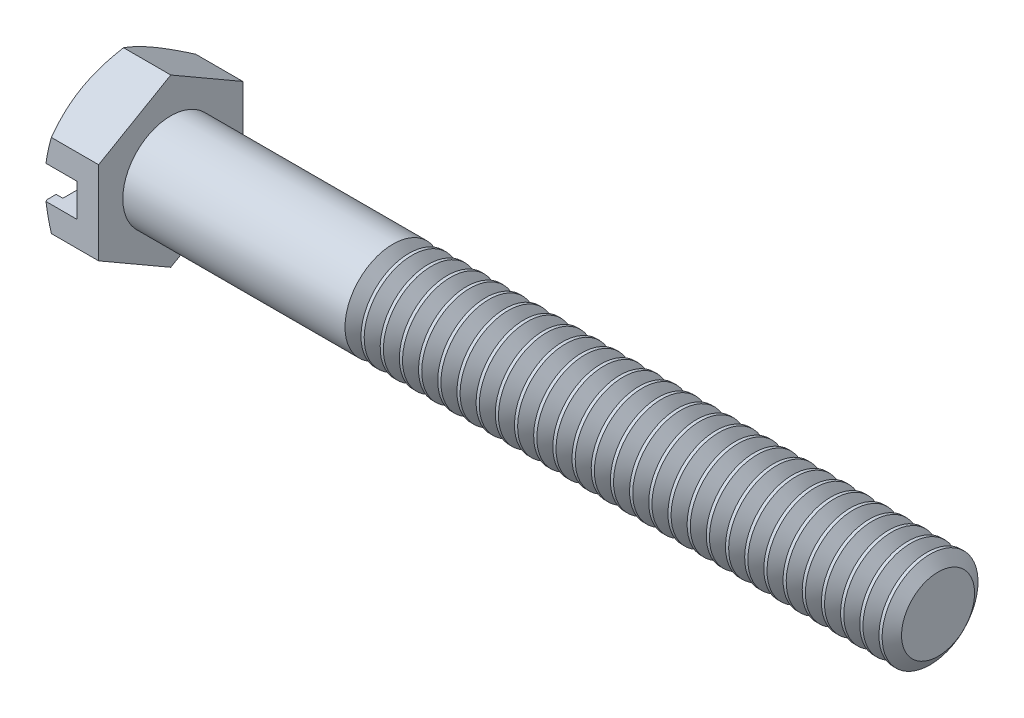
ISO-10303-21;
HEADER;
FILE_DESCRIPTION(('STEP AP214'),'2;1');
FILE_NAME('part.step','',(''),(''),'','','');
FILE_SCHEMA(('AUTOMOTIVE_DESIGN { 1 0 10303 214 1 1 1 1 }'));
ENDSEC;
DATA;
#1=APPLICATION_CONTEXT('core data for automotive mechanical design processes');
#2=APPLICATION_PROTOCOL_DEFINITION('international standard','automotive_design',2000,#1);
#3=PRODUCT_CONTEXT('',#1,'mechanical');
#4=PRODUCT('Part','Part','',(#3));
#5=PRODUCT_RELATED_PRODUCT_CATEGORY('part','',(#4));
#6=PRODUCT_DEFINITION_FORMATION('','',#4);
#7=PRODUCT_DEFINITION_CONTEXT('part definition',#1,'design');
#8=PRODUCT_DEFINITION('design','',#6,#7);
#9=PRODUCT_DEFINITION_SHAPE('','',#8);
#10=(LENGTH_UNIT() NAMED_UNIT(*) SI_UNIT(.MILLI.,.METRE.));
#11=(NAMED_UNIT(*) PLANE_ANGLE_UNIT() SI_UNIT($,.RADIAN.));
#12=(NAMED_UNIT(*) SI_UNIT($,.STERADIAN.) SOLID_ANGLE_UNIT());
#13=UNCERTAINTY_MEASURE_WITH_UNIT(LENGTH_MEASURE(1.E-05),#10,'distance_accuracy_value','');
#14=(GEOMETRIC_REPRESENTATION_CONTEXT(3) GLOBAL_UNCERTAINTY_ASSIGNED_CONTEXT((#13)) GLOBAL_UNIT_ASSIGNED_CONTEXT((#10,
#11,#12)) REPRESENTATION_CONTEXT('',''));
#15=CARTESIAN_POINT('',(0.,0.,0.));
#16=DIRECTION('',(0.,0.,1.));
#17=DIRECTION('',(1.,0.,0.));
#18=AXIS2_PLACEMENT_3D('',#15,#16,#17);
#19=CARTESIAN_POINT('',(0.,0.,0.));
#20=DIRECTION('',(-1.,0.,0.));
#21=DIRECTION('',(0.,0.,1.));
#22=AXIS2_PLACEMENT_3D('',#19,#20,#21);
#23=PLANE('',#22);
#24=DIRECTION('',(0.,0.,-1.));
#25=VECTOR('',#24,1.);
#26=CARTESIAN_POINT('',(0.,-0.5461,0.));
#27=LINE('',#26,#25);
#28=CARTESIAN_POINT('',(0.,-0.546100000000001,2.32430818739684));
#29=VERTEX_POINT('',#28);
#30=CARTESIAN_POINT('',(0.,-0.5461,2.01651246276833));
#31=VERTEX_POINT('',#30);
#32=EDGE_CURVE('E180',#29,#31,#27,.T.);
#33=ORIENTED_EDGE('',*,*,#32,.T.);
#34=CARTESIAN_POINT('',(0.,0.,0.));
#35=DIRECTION('',(1.,0.,0.));
#36=DIRECTION('',(0.,0.,-1.));
#37=AXIS2_PLACEMENT_3D('',#34,#35,#36);
#38=CIRCLE('',#37,2.08915);
#39=CARTESIAN_POINT('',(0.,-0.5461,-2.01651246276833));
#40=VERTEX_POINT('',#39);
#41=EDGE_CURVE('E165',#31,#40,#38,.T.);
#42=ORIENTED_EDGE('',*,*,#41,.T.);
#43=CARTESIAN_POINT('',(0.,-0.5461,-2.32430818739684));
#44=VERTEX_POINT('',#43);
#45=EDGE_CURVE('E177',#40,#44,#27,.T.);
#46=ORIENTED_EDGE('',*,*,#45,.T.);
#47=CARTESIAN_POINT('',(0.,0.,0.));
#48=DIRECTION('',(-1.,0.,0.));
#49=DIRECTION('',(0.,0.,1.));
#50=AXIS2_PLACEMENT_3D('',#47,#48,#49);
#51=CIRCLE('',#50,2.3876);
#52=CARTESIAN_POINT('',(0.,-2.06772225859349,-1.19380000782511));
#53=VERTEX_POINT('',#52);
#54=EDGE_CURVE('E184',#44,#53,#51,.T.);
#55=ORIENTED_EDGE('',*,*,#54,.T.);
#56=CARTESIAN_POINT('',(0.,-2.06772225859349,1.19380000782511));
#57=VERTEX_POINT('',#56);
#58=EDGE_CURVE('E225',#53,#57,#51,.T.);
#59=ORIENTED_EDGE('',*,*,#58,.T.);
#60=EDGE_CURVE('E203',#57,#29,#51,.T.);
#61=ORIENTED_EDGE('',*,*,#60,.T.);
#62=EDGE_LOOP('',(#33,#42,#46,#55,#59,#61));
#63=FACE_BOUND('',#62,.T.);
#64=ADVANCED_FACE('F34',(#63),#23,.T.);
#65=DIRECTION('',(0.,0.,1.));
#66=VECTOR('',#65,1.);
#67=CARTESIAN_POINT('',(0.,0.5461,0.));
#68=LINE('',#67,#66);
#69=CARTESIAN_POINT('',(0.,0.5461,-2.32430818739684));
#70=VERTEX_POINT('',#69);
#71=CARTESIAN_POINT('',(0.,0.5461,-2.01651246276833));
#72=VERTEX_POINT('',#71);
#73=EDGE_CURVE('E169',#70,#72,#68,.T.);
#74=ORIENTED_EDGE('',*,*,#73,.T.);
#75=CARTESIAN_POINT('',(0.,0.5461,2.01651246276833));
#76=VERTEX_POINT('',#75);
#77=EDGE_CURVE('E158',#72,#76,#38,.T.);
#78=ORIENTED_EDGE('',*,*,#77,.T.);
#79=CARTESIAN_POINT('',(0.,0.5461,2.32430818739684));
#80=VERTEX_POINT('',#79);
#81=EDGE_CURVE('E178',#76,#80,#68,.T.);
#82=ORIENTED_EDGE('',*,*,#81,.T.);
#83=CARTESIAN_POINT('',(0.,2.06772225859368,1.19380000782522));
#84=VERTEX_POINT('',#83);
#85=EDGE_CURVE('E182',#80,#84,#51,.T.);
#86=ORIENTED_EDGE('',*,*,#85,.T.);
#87=CARTESIAN_POINT('',(0.,2.06772225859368,-1.19380000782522));
#88=VERTEX_POINT('',#87);
#89=EDGE_CURVE('E200',#84,#88,#51,.T.);
#90=ORIENTED_EDGE('',*,*,#89,.T.);
#91=EDGE_CURVE('E176',#88,#70,#51,.T.);
#92=ORIENTED_EDGE('',*,*,#91,.T.);
#93=EDGE_LOOP('',(#74,#78,#82,#86,#90,#92));
#94=FACE_BOUND('',#93,.T.);
#95=ADVANCED_FACE('F173',(#94),#23,.T.);
#96=CARTESIAN_POINT('',(1.0668,-0.5461,-2.75704387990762));
#97=DIRECTION('',(0.,1.,0.));
#98=DIRECTION('',(0.,0.,1.));
#99=AXIS2_PLACEMENT_3D('',#96,#97,#98);
#100=PLANE('',#99);
#101=ORIENTED_EDGE('',*,*,#45,.F.);
#102=DIRECTION('',(-1.,0.,0.));
#103=VECTOR('',#102,1.);
#104=CARTESIAN_POINT('',(0.22225,-0.5461,-2.01651246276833));
#105=LINE('',#104,#103);
#106=CARTESIAN_POINT('',(0.22225,-0.5461,-2.01651246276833));
#107=VERTEX_POINT('',#106);
#108=EDGE_CURVE('E557',#40,#107,#105,.F.);
#109=ORIENTED_EDGE('',*,*,#108,.T.);
#110=DIRECTION('',(0.,0.,-1.));
#111=VECTOR('',#110,1.);
#112=CARTESIAN_POINT('',(0.22225,-0.5461,-2.75704387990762));
#113=LINE('',#112,#111);
#114=CARTESIAN_POINT('',(0.22225,-0.5461,2.01651246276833));
#115=VERTEX_POINT('',#114);
#116=EDGE_CURVE('E192',#115,#107,#113,.T.);
#117=ORIENTED_EDGE('',*,*,#116,.F.);
#118=DIRECTION('',(-1.,0.,0.));
#119=VECTOR('',#118,1.);
#120=CARTESIAN_POINT('',(0.22225,-0.5461,2.01651246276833));
#121=LINE('',#120,#119);
#122=EDGE_CURVE('E554',#115,#31,#121,.T.);
#123=ORIENTED_EDGE('',*,*,#122,.T.);
#124=ORIENTED_EDGE('',*,*,#32,.F.);
#125=CARTESIAN_POINT('',(1.09737356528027,-0.546100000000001,4.25339273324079));
#126=CARTESIAN_POINT('',(1.00448825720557,-0.546100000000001,4.09117460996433));
#127=CARTESIAN_POINT('',(0.911655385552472,-0.546100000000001,3.92892631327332));
#128=CARTESIAN_POINT('',(0.726198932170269,-0.546100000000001,3.60435697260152));
#129=CARTESIAN_POINT('',(0.63357530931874,-0.546100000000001,3.44203595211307));
#130=CARTESIAN_POINT('',(0.448663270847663,-0.546100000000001,3.11734706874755));
#131=CARTESIAN_POINT('',(0.35637467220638,-0.546100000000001,2.95497931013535));
#132=CARTESIAN_POINT('',(0.172210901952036,-0.546100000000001,2.62996362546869));
#133=CARTESIAN_POINT('',(0.0803358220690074,-0.546100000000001,2.46731564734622));
#134=CARTESIAN_POINT('',(-0.0569668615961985,-0.546100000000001,2.22290874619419));
#135=CARTESIAN_POINT('',(-0.102680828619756,-0.5461,2.1413107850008));
#136=CARTESIAN_POINT('',(-0.193836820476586,-0.5461,1.97796988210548));
#137=CARTESIAN_POINT('',(-0.239278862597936,-0.5461,1.89622695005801));
#138=CARTESIAN_POINT('',(-0.329752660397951,-0.5461,1.73257886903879));
#139=CARTESIAN_POINT('',(-0.374784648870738,-0.5461,1.65067384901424));
#140=CARTESIAN_POINT('',(-0.46428413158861,-0.5461,1.48653094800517));
#141=CARTESIAN_POINT('',(-0.508751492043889,-0.5461,1.40429299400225));
#142=CARTESIAN_POINT('',(-0.596873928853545,-0.5461,1.2391605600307));
#143=CARTESIAN_POINT('',(-0.640527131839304,-0.5461,1.15626507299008));
#144=CARTESIAN_POINT('',(-0.704801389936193,-0.5461,1.03133818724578));
#145=CARTESIAN_POINT('',(-0.726017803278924,-0.5461,0.989613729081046));
#146=CARTESIAN_POINT('',(-0.767905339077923,-0.5461,0.905883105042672));
#147=CARTESIAN_POINT('',(-0.788576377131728,-0.5461,0.863876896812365));
#148=CARTESIAN_POINT('',(-0.82920718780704,-0.5461,0.779378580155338));
#149=CARTESIAN_POINT('',(-0.849164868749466,-0.5461,0.736885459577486));
#150=CARTESIAN_POINT('',(-0.887952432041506,-0.5461,0.651406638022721));
#151=CARTESIAN_POINT('',(-0.906782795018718,-0.5461,0.608421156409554));
#152=CARTESIAN_POINT('',(-0.942816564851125,-0.5461,0.521634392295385));
#153=CARTESIAN_POINT('',(-0.960015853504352,-0.5461,0.477831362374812));
#154=CARTESIAN_POINT('',(-0.983865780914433,-0.5461,0.41138615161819));
#155=CARTESIAN_POINT('',(-0.99149578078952,-0.5461,0.389097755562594));
#156=CARTESIAN_POINT('',(-1.00592972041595,-0.5461,0.344244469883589));
#157=CARTESIAN_POINT('',(-1.01273326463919,-0.5461,0.321679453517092));
#158=CARTESIAN_POINT('',(-1.0190345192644,-0.5461,0.29896687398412));
#159=B_SPLINE_CURVE_WITH_KNOTS('',3,(#125,#126,#127,#128,#129,#130,#131,#132,#133,#134,#135,
#136,#137,#138,#139,#140,#141,#142,#143,#144,#145,#146,#147,#148,#149,#150,#151,#152,#153,#154,
#155,#156,#157,#158),.UNSPECIFIED.,.F.,.F.,(4,2,2,2,2,2,2,2,2,2,2,2,2,2,2,2,4),(0.,
0.560786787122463,1.12145162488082,1.68174078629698,2.24214864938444,2.52274042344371,
2.80331416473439,3.08371720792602,3.36418549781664,3.64523475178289,3.78565839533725,
3.92610364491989,4.06693160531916,4.20769909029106,4.34881302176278,4.41947326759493,
4.49016719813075),.UNSPECIFIED.);
#160=CARTESIAN_POINT('',(0.0355975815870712,-0.546100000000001,2.3876));
#161=VERTEX_POINT('',#160);
#162=EDGE_CURVE('E598',#161,#29,#159,.T.);
#163=ORIENTED_EDGE('',*,*,#162,.F.);
#164=DIRECTION('',(-1.,0.,0.));
#165=VECTOR('',#164,1.);
#166=CARTESIAN_POINT('',(1.778,-0.546100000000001,2.3876));
#167=LINE('',#166,#165);
#168=CARTESIAN_POINT('',(1.0668,-0.546100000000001,2.3876));
#169=VERTEX_POINT('',#168);
#170=EDGE_CURVE('E604',#169,#161,#167,.T.);
#171=ORIENTED_EDGE('',*,*,#170,.F.);
#172=DIRECTION('',(0.,0.,-1.));
#173=VECTOR('',#172,1.);
#174=CARTESIAN_POINT('',(1.0668,-0.5461,-2.75704387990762));
#175=LINE('',#174,#173);
#176=CARTESIAN_POINT('',(1.0668,-0.5461,-2.3876));
#177=VERTEX_POINT('',#176);
#178=EDGE_CURVE('E560',#169,#177,#175,.T.);
#179=ORIENTED_EDGE('',*,*,#178,.T.);
#180=DIRECTION('',(1.,0.,0.));
#181=VECTOR('',#180,1.);
#182=CARTESIAN_POINT('',(1.778,-0.5461,-2.3876));
#183=LINE('',#182,#181);
#184=CARTESIAN_POINT('',(0.0355975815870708,-0.5461,-2.3876));
#185=VERTEX_POINT('',#184);
#186=EDGE_CURVE('E595',#185,#177,#183,.T.);
#187=ORIENTED_EDGE('',*,*,#186,.F.);
#188=CARTESIAN_POINT('',(-1.0190345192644,-0.5461,-0.298966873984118));
#189=CARTESIAN_POINT('',(-1.01150289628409,-0.5461,-0.326090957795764));
#190=CARTESIAN_POINT('',(-1.00326467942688,-0.5461,-0.353004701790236));
#191=CARTESIAN_POINT('',(-0.985657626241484,-0.5461,-0.406441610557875));
#192=CARTESIAN_POINT('',(-0.976289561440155,-0.5461,-0.432965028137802));
#193=CARTESIAN_POINT('',(-0.956712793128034,-0.5461,-0.485638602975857));
#194=CARTESIAN_POINT('',(-0.946505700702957,-0.5461,-0.511789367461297));
#195=CARTESIAN_POINT('',(-0.925424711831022,-0.5461,-0.563825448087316));
#196=CARTESIAN_POINT('',(-0.914550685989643,-0.5461,-0.58971071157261));
#197=CARTESIAN_POINT('',(-0.881219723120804,-0.5461,-0.666900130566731));
#198=CARTESIAN_POINT('',(-0.858001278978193,-0.5461,-0.717874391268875));
#199=CARTESIAN_POINT('',(-0.810285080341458,-0.5461,-0.819249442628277));
#200=CARTESIAN_POINT('',(-0.785786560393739,-0.5461,-0.869649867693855));
#201=CARTESIAN_POINT('',(-0.731728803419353,-0.5461,-0.978541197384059));
#202=CARTESIAN_POINT('',(-0.702015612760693,-0.5461,-1.0369554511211));
#203=CARTESIAN_POINT('',(-0.641846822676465,-0.5461,-1.15340041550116));
#204=CARTESIAN_POINT('',(-0.611391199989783,-0.5461,-1.21143111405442));
#205=CARTESIAN_POINT('',(-0.519292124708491,-0.5461,-1.38510740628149));
#206=CARTESIAN_POINT('',(-0.456905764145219,-0.5461,-1.50035823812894));
#207=CARTESIAN_POINT('',(-0.330961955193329,-0.5461,-1.73060256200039));
#208=CARTESIAN_POINT('',(-0.267401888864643,-0.5461,-1.84559461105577));
#209=CARTESIAN_POINT('',(-0.139676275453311,-0.5461,-2.07524400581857));
#210=CARTESIAN_POINT('',(-0.0755107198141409,-0.5461,-2.18990134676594));
#211=CARTESIAN_POINT('',(0.0805514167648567,-0.5461,-2.46769690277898));
#212=CARTESIAN_POINT('',(0.172641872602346,-0.5461,-2.63072602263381));
#213=CARTESIAN_POINT('',(0.357258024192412,-0.5461,-2.95653648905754));
#214=CARTESIAN_POINT('',(0.449783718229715,-0.5461,-3.11931783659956));
#215=CARTESIAN_POINT('',(0.634718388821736,-0.5461,-3.44403966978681));
#216=CARTESIAN_POINT('',(0.727126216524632,-0.5461,-3.60598081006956));
#217=CARTESIAN_POINT('',(0.912129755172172,-0.5461,-3.92975558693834));
#218=CARTESIAN_POINT('',(1.00472546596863,-0.5461,-4.09158922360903));
#219=CARTESIAN_POINT('',(1.09737356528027,-0.5461,-4.25339273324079));
#220=B_SPLINE_CURVE_WITH_KNOTS('',3,(#188,#189,#190,#191,#192,#193,#194,#195,#196,#197,#198,
#199,#200,#201,#202,#203,#204,#205,#206,#207,#208,#209,#210,#211,#212,#213,#214,#215,#216,#217,
#218,#219),.UNSPECIFIED.,.F.,.F.,(4,2,2,2,2,2,2,2,2,2,2,2,2,2,2,4),(0.,0.0844217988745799,
0.168786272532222,0.252992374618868,0.337214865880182,0.505221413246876,0.673329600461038,
0.869931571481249,1.06653971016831,1.45968518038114,1.85385043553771,2.24802126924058,
2.8097427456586,3.37146201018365,3.93081618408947,4.49016991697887),.UNSPECIFIED.);
#221=EDGE_CURVE('E589',#44,#185,#220,.T.);
#222=ORIENTED_EDGE('',*,*,#221,.F.);
#223=EDGE_LOOP('',(#101,#109,#117,#123,#124,#163,#171,#179,#187,#222));
#224=FACE_BOUND('',#223,.T.);
#225=ADVANCED_FACE('F282',(#224),#100,.T.);
#226=CARTESIAN_POINT('',(1.0668,0.5461,2.75704387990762));
#227=DIRECTION('',(0.,-1.,0.));
#228=DIRECTION('',(0.,0.,-1.));
#229=AXIS2_PLACEMENT_3D('',#226,#227,#228);
#230=PLANE('',#229);
#231=ORIENTED_EDGE('',*,*,#81,.F.);
#232=DIRECTION('',(-1.,0.,0.));
#233=VECTOR('',#232,1.);
#234=CARTESIAN_POINT('',(0.22225,0.5461,2.01651246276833));
#235=LINE('',#234,#233);
#236=CARTESIAN_POINT('',(0.22225,0.5461,2.01651246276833));
#237=VERTEX_POINT('',#236);
#238=EDGE_CURVE('E11',#76,#237,#235,.F.);
#239=ORIENTED_EDGE('',*,*,#238,.T.);
#240=DIRECTION('',(0.,0.,1.));
#241=VECTOR('',#240,1.);
#242=CARTESIAN_POINT('',(0.22225,0.5461,2.75704387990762));
#243=LINE('',#242,#241);
#244=CARTESIAN_POINT('',(0.22225,0.5461,-2.01651246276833));
#245=VERTEX_POINT('',#244);
#246=EDGE_CURVE('E171',#245,#237,#243,.T.);
#247=ORIENTED_EDGE('',*,*,#246,.F.);
#248=DIRECTION('',(-1.,0.,0.));
#249=VECTOR('',#248,1.);
#250=CARTESIAN_POINT('',(0.22225,0.5461,-2.01651246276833));
#251=LINE('',#250,#249);
#252=EDGE_CURVE('E42',#245,#72,#251,.T.);
#253=ORIENTED_EDGE('',*,*,#252,.T.);
#254=ORIENTED_EDGE('',*,*,#73,.F.);
#255=CARTESIAN_POINT('',(1.09737356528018,0.5461,-4.25339273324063));
#256=CARTESIAN_POINT('',(1.00448825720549,0.5461,-4.09117460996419));
#257=CARTESIAN_POINT('',(0.911655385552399,0.5461,-3.92892631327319));
#258=CARTESIAN_POINT('',(0.726198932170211,0.5461,-3.60435697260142));
#259=CARTESIAN_POINT('',(0.633575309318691,0.5461,-3.44203595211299));
#260=CARTESIAN_POINT('',(0.448663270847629,0.5461,-3.11734706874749));
#261=CARTESIAN_POINT('',(0.356374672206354,0.5461,-2.95497931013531));
#262=CARTESIAN_POINT('',(0.172210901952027,0.5461,-2.62996362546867));
#263=CARTESIAN_POINT('',(0.0803358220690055,0.5461,-2.46731564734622));
#264=CARTESIAN_POINT('',(-0.0569668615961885,0.5461,-2.2229087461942));
#265=CARTESIAN_POINT('',(-0.102680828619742,0.5461,-2.14131078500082));
#266=CARTESIAN_POINT('',(-0.193836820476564,0.5461,-1.97796988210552));
#267=CARTESIAN_POINT('',(-0.23927886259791,0.5461,-1.89622695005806));
#268=CARTESIAN_POINT('',(-0.329752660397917,0.5461,-1.73257886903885));
#269=CARTESIAN_POINT('',(-0.374784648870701,0.5461,-1.65067384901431));
#270=CARTESIAN_POINT('',(-0.464284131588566,0.5461,-1.48653094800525));
#271=CARTESIAN_POINT('',(-0.508751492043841,0.5461,-1.40429299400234));
#272=CARTESIAN_POINT('',(-0.59687392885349,0.5461,-1.2391605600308));
#273=CARTESIAN_POINT('',(-0.640527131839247,0.5461,-1.15626507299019));
#274=CARTESIAN_POINT('',(-0.704801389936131,0.5461,-1.0313381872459));
#275=CARTESIAN_POINT('',(-0.72601780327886,0.5461,-0.989613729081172));
#276=CARTESIAN_POINT('',(-0.767905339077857,0.5461,-0.905883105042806));
#277=CARTESIAN_POINT('',(-0.788576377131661,0.5461,-0.863876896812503));
#278=CARTESIAN_POINT('',(-0.829207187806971,0.5461,-0.779378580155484));
#279=CARTESIAN_POINT('',(-0.849164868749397,0.5461,-0.736885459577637));
#280=CARTESIAN_POINT('',(-0.887952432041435,0.5461,-0.65140663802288));
#281=CARTESIAN_POINT('',(-0.906782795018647,0.5461,-0.608421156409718));
#282=CARTESIAN_POINT('',(-0.942816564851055,0.5461,-0.521634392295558));
#283=CARTESIAN_POINT('',(-0.960015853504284,0.5461,-0.477831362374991));
#284=CARTESIAN_POINT('',(-0.983865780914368,0.5461,-0.411386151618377));
#285=CARTESIAN_POINT('',(-0.991495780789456,0.5461,-0.389097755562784));
#286=CARTESIAN_POINT('',(-1.00592972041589,0.5461,-0.344244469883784));
#287=CARTESIAN_POINT('',(-1.01273326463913,0.5461,-0.321679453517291));
#288=CARTESIAN_POINT('',(-1.01903451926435,0.5461,-0.298966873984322));
#289=B_SPLINE_CURVE_WITH_KNOTS('',3,(#255,#256,#257,#258,#259,#260,#261,#262,#263,#264,#265,
#266,#267,#268,#269,#270,#271,#272,#273,#274,#275,#276,#277,#278,#279,#280,#281,#282,#283,#284,
#285,#286,#287,#288),.UNSPECIFIED.,.F.,.F.,(4,2,2,2,2,2,2,2,2,2,2,2,2,2,2,2,4),(0.,
0.560786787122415,1.12145162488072,1.68174078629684,2.24214864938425,2.52274042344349,
2.80331416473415,3.08371720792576,3.36418549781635,3.64523475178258,3.78565839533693,
3.92610364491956,4.06693160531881,4.2076990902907,4.3488130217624,4.41947326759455,
4.49016719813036),.UNSPECIFIED.);
#290=CARTESIAN_POINT('',(0.0355975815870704,0.5461,-2.3876));
#291=VERTEX_POINT('',#290);
#292=EDGE_CURVE('E581',#291,#70,#289,.T.);
#293=ORIENTED_EDGE('',*,*,#292,.F.);
#294=DIRECTION('',(-1.,0.,0.));
#295=VECTOR('',#294,1.);
#296=CARTESIAN_POINT('',(1.778,0.5461,-2.3876));
#297=LINE('',#296,#295);
#298=CARTESIAN_POINT('',(1.0668,0.5461,-2.3876));
#299=VERTEX_POINT('',#298);
#300=EDGE_CURVE('E586',#299,#291,#297,.T.);
#301=ORIENTED_EDGE('',*,*,#300,.F.);
#302=DIRECTION('',(0.,0.,1.));
#303=VECTOR('',#302,1.);
#304=CARTESIAN_POINT('',(1.0668,0.5461,2.75704387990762));
#305=LINE('',#304,#303);
#306=CARTESIAN_POINT('',(1.0668,0.5461,2.3876));
#307=VERTEX_POINT('',#306);
#308=EDGE_CURVE('E563',#299,#307,#305,.T.);
#309=ORIENTED_EDGE('',*,*,#308,.T.);
#310=DIRECTION('',(1.,0.,0.));
#311=VECTOR('',#310,1.);
#312=CARTESIAN_POINT('',(1.778,0.5461,2.3876));
#313=LINE('',#312,#311);
#314=CARTESIAN_POINT('',(0.0355975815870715,0.5461,2.3876));
#315=VERTEX_POINT('',#314);
#316=EDGE_CURVE('E571',#315,#307,#313,.T.);
#317=ORIENTED_EDGE('',*,*,#316,.F.);
#318=CARTESIAN_POINT('',(-1.01903451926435,0.5461,0.29896687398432));
#319=CARTESIAN_POINT('',(-1.01150289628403,0.5461,0.326090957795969));
#320=CARTESIAN_POINT('',(-1.00326467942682,0.5461,0.353004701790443));
#321=CARTESIAN_POINT('',(-0.985657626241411,0.5461,0.406441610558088));
#322=CARTESIAN_POINT('',(-0.976289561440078,0.5461,0.432965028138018));
#323=CARTESIAN_POINT('',(-0.956712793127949,0.5461,0.485638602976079));
#324=CARTESIAN_POINT('',(-0.946505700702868,0.5461,0.511789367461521));
#325=CARTESIAN_POINT('',(-0.925424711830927,0.5461,0.563825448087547));
#326=CARTESIAN_POINT('',(-0.914550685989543,0.5461,0.589710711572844));
#327=CARTESIAN_POINT('',(-0.881219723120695,0.5461,0.666900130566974));
#328=CARTESIAN_POINT('',(-0.858001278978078,0.5461,0.717874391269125));
#329=CARTESIAN_POINT('',(-0.810285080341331,0.5461,0.81924944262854));
#330=CARTESIAN_POINT('',(-0.785786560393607,0.5461,0.869649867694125));
#331=CARTESIAN_POINT('',(-0.731728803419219,0.5461,0.978541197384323));
#332=CARTESIAN_POINT('',(-0.702015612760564,0.5461,1.03695545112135));
#333=CARTESIAN_POINT('',(-0.641846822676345,0.5461,1.15340041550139));
#334=CARTESIAN_POINT('',(-0.611391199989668,0.5461,1.21143111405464));
#335=CARTESIAN_POINT('',(-0.51929212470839,0.5461,1.38510740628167));
#336=CARTESIAN_POINT('',(-0.45690576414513,0.5461,1.5003582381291));
#337=CARTESIAN_POINT('',(-0.330961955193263,0.5461,1.73060256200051));
#338=CARTESIAN_POINT('',(-0.267401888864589,0.5461,1.84559461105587));
#339=CARTESIAN_POINT('',(-0.13967627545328,0.5461,2.07524400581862));
#340=CARTESIAN_POINT('',(-0.0755107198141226,0.5461,2.18990134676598));
#341=CARTESIAN_POINT('',(0.0805514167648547,0.5461,2.46769690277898));
#342=CARTESIAN_POINT('',(0.172641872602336,0.5461,2.6307260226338));
#343=CARTESIAN_POINT('',(0.357258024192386,0.5461,2.95653648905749));
#344=CARTESIAN_POINT('',(0.449783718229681,0.5461,3.1193178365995));
#345=CARTESIAN_POINT('',(0.634718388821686,0.5461,3.44403966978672));
#346=CARTESIAN_POINT('',(0.727126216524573,0.5461,3.60598081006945));
#347=CARTESIAN_POINT('',(0.912129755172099,0.5461,3.92975558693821));
#348=CARTESIAN_POINT('',(1.00472546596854,0.5461,4.09158922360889));
#349=CARTESIAN_POINT('',(1.09737356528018,0.5461,4.25339273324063));
#350=B_SPLINE_CURVE_WITH_KNOTS('',3,(#318,#319,#320,#321,#322,#323,#324,#325,#326,#327,#328,
#329,#330,#331,#332,#333,#334,#335,#336,#337,#338,#339,#340,#341,#342,#343,#344,#345,#346,#347,
#348,#349),.UNSPECIFIED.,.F.,.F.,(4,2,2,2,2,2,2,2,2,2,2,2,2,2,2,4),(0.,0.084421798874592,
0.168786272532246,0.252992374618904,0.337214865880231,0.50522141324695,0.673329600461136,
0.869931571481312,1.06653971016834,1.45968518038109,1.85385043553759,2.24802126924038,
2.80974274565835,3.37146201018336,3.93081618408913,4.49016991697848),.UNSPECIFIED.);
#351=EDGE_CURVE('E196',#80,#315,#350,.T.);
#352=ORIENTED_EDGE('',*,*,#351,.F.);
#353=EDGE_LOOP('',(#231,#239,#247,#253,#254,#293,#301,#309,#317,#352));
#354=FACE_BOUND('',#353,.T.);
#355=ADVANCED_FACE('F168',(#354),#230,.T.);
#356=CARTESIAN_POINT('',(1.778,-1.37848150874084,2.3876));
#357=DIRECTION('',(0.,0.,1.));
#358=DIRECTION('',(0.,-1.,0.));
#359=AXIS2_PLACEMENT_3D('',#356,#357,#358);
#360=PLANE('',#359);
#361=DIRECTION('',(0.,-1.,0.));
#362=VECTOR('',#361,1.);
#363=CARTESIAN_POINT('',(1.0668,-1.37848150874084,2.3876));
#364=LINE('',#363,#362);
#365=EDGE_CURVE('E607',#307,#169,#364,.T.);
#366=ORIENTED_EDGE('',*,*,#365,.T.);
#367=ORIENTED_EDGE('',*,*,#170,.T.);
#368=CARTESIAN_POINT('',(1.14253349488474,-3.65594257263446,2.3876));
#369=CARTESIAN_POINT('',(1.09187421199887,-3.55111338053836,2.3876));
#370=CARTESIAN_POINT('',(1.04171852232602,-3.4460363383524,2.3876));
#371=CARTESIAN_POINT('',(0.942702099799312,-3.23525254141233,2.3876));
#372=CARTESIAN_POINT('',(0.893841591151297,-3.12954568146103,2.3876));
#373=CARTESIAN_POINT('',(0.797445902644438,-2.91679721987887,2.3876));
#374=CARTESIAN_POINT('',(0.749919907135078,-2.80975144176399,2.3876));
#375=CARTESIAN_POINT('',(0.656909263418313,-2.59478006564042,2.3876));
#376=CARTESIAN_POINT('',(0.6114245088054,-2.48685451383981,2.3876));
#377=CARTESIAN_POINT('',(0.522499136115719,-2.26861209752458,2.3876));
#378=CARTESIAN_POINT('',(0.479090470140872,-2.15828214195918,2.3876));
#379=CARTESIAN_POINT('',(0.395672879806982,-1.93632088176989,2.3876));
#380=CARTESIAN_POINT('',(0.355664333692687,-1.82468943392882,2.3876));
#381=CARTESIAN_POINT('',(0.280121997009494,-1.60017686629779,2.3876));
#382=CARTESIAN_POINT('',(0.244578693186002,-1.48729898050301,2.3876));
#383=CARTESIAN_POINT('',(0.179121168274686,-1.25993850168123,2.3876));
#384=CARTESIAN_POINT('',(0.149205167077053,-1.14545642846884,2.3876));
#385=CARTESIAN_POINT('',(0.0964545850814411,-0.914809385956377,2.3876));
#386=CARTESIAN_POINT('',(0.0736218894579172,-0.798643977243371,2.3876));
#387=CARTESIAN_POINT('',(0.0365752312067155,-0.564912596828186,2.3876));
#388=CARTESIAN_POINT('',(0.0223612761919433,-0.447346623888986,2.3876));
#389=CARTESIAN_POINT('',(0.00380953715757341,-0.212173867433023,2.3876));
#390=CARTESIAN_POINT('',(-0.000590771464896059,-0.0945721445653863,2.3876));
#391=CARTESIAN_POINT('',(0.000718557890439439,0.140548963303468,2.3876));
#392=CARTESIAN_POINT('',(0.0064255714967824,0.258068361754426,2.3876));
#393=CARTESIAN_POINT('',(0.0244000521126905,0.458749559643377,2.3876));
#394=CARTESIAN_POINT('',(0.0343267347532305,0.542132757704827,2.3876));
#395=CARTESIAN_POINT('',(0.0586228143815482,0.708255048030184,2.3876));
#396=CARTESIAN_POINT('',(0.0729929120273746,0.790994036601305,2.3876));
#397=CARTESIAN_POINT('',(0.122014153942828,1.03817723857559,2.3876));
#398=CARTESIAN_POINT('',(0.162563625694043,1.20146282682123,2.3876));
#399=CARTESIAN_POINT('',(0.232500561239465,1.44579488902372,2.3876));
#400=CARTESIAN_POINT('',(0.257688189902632,1.52811494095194,2.3876));
#401=CARTESIAN_POINT('',(0.310555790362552,1.69189584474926,2.3876));
#402=CARTESIAN_POINT('',(0.338234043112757,1.77335724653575,2.3876));
#403=CARTESIAN_POINT('',(0.395506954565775,1.93508020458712,2.3876));
#404=CARTESIAN_POINT('',(0.425089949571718,2.01534593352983,2.3876));
#405=CARTESIAN_POINT('',(0.485992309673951,2.175254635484,2.3876));
#406=CARTESIAN_POINT('',(0.517312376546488,2.25489734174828,2.3876));
#407=CARTESIAN_POINT('',(0.549329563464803,2.33425207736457,2.3876));
#408=B_SPLINE_CURVE_WITH_KNOTS('',3,(#368,#369,#370,#371,#372,#373,#374,#375,#376,#377,#378,
#379,#380,#381,#382,#383,#384,#385,#386,#387,#388,#389,#390,#391,#392,#393,#394,#395,#396,#397,
#398,#399,#400,#401,#402,#403,#404,#405,#406,#407),.UNSPECIFIED.,.F.,.F.,(4,2,2,2,2,2,2,2,2,2,2,
2,2,2,2,2,2,2,2,4),(0.,0.349289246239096,0.698638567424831,1.04998706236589,1.40131722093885,
1.75696072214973,2.11264373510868,2.46755562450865,2.8223550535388,3.17724882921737,
3.53214291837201,3.88476937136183,4.23730427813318,4.48909732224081,4.74093009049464,
5.2449704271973,5.50321155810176,5.76127579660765,6.01788747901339,6.27460359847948),.UNSPECIFIED.);
#409=CARTESIAN_POINT('',(0.213251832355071,-1.37848150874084,2.3876));
#410=VERTEX_POINT('',#409);
#411=EDGE_CURVE('E235',#410,#161,#408,.T.);
#412=ORIENTED_EDGE('',*,*,#411,.F.);
#413=DIRECTION('',(-1.,0.,0.));
#414=VECTOR('',#413,1.);
#415=CARTESIAN_POINT('',(1.778,-1.37848150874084,2.3876));
#416=LINE('',#415,#414);
#417=CARTESIAN_POINT('',(1.778,-1.37848150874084,2.3876));
#418=VERTEX_POINT('',#417);
#419=EDGE_CURVE('E217',#418,#410,#416,.T.);
#420=ORIENTED_EDGE('',*,*,#419,.F.);
#421=DIRECTION('',(0.,1.,0.));
#422=VECTOR('',#421,1.);
#423=CARTESIAN_POINT('',(1.778,-1.37848150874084,2.3876));
#424=LINE('',#423,#422);
#425=CARTESIAN_POINT('',(1.778,1.3784815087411,2.3876));
#426=VERTEX_POINT('',#425);
#427=EDGE_CURVE('E610',#418,#426,#424,.T.);
#428=ORIENTED_EDGE('',*,*,#427,.T.);
#429=DIRECTION('',(-1.,0.,0.));
#430=VECTOR('',#429,1.);
#431=CARTESIAN_POINT('',(1.778,1.3784815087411,2.3876));
#432=LINE('',#431,#430);
#433=CARTESIAN_POINT('',(0.213251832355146,1.3784815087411,2.3876));
#434=VERTEX_POINT('',#433);
#435=EDGE_CURVE('E626',#426,#434,#432,.T.);
#436=ORIENTED_EDGE('',*,*,#435,.T.);
#437=EDGE_CURVE('E221',#315,#434,#408,.T.);
#438=ORIENTED_EDGE('',*,*,#437,.F.);
#439=ORIENTED_EDGE('',*,*,#316,.T.);
#440=EDGE_LOOP('',(#366,#367,#412,#420,#428,#436,#438,#439));
#441=FACE_BOUND('',#440,.T.);
#442=ADVANCED_FACE('F257',(#441),#360,.T.);
#443=CARTESIAN_POINT('',(1.778,1.3784815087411,-2.3876));
#444=DIRECTION('',(0.,0.,-1.));
#445=DIRECTION('',(-1.,0.,0.));
#446=AXIS2_PLACEMENT_3D('',#443,#444,#445);
#447=PLANE('',#446);
#448=CARTESIAN_POINT('',(1.14253349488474,-3.65594257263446,-2.3876));
#449=CARTESIAN_POINT('',(1.09187421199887,-3.55111338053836,-2.3876));
#450=CARTESIAN_POINT('',(1.04171852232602,-3.4460363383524,-2.3876));
#451=CARTESIAN_POINT('',(0.942702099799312,-3.23525254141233,-2.3876));
#452=CARTESIAN_POINT('',(0.893841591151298,-3.12954568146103,-2.3876));
#453=CARTESIAN_POINT('',(0.797445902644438,-2.91679721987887,-2.3876));
#454=CARTESIAN_POINT('',(0.749919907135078,-2.80975144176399,-2.3876));
#455=CARTESIAN_POINT('',(0.656909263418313,-2.59478006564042,-2.3876));
#456=CARTESIAN_POINT('',(0.6114245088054,-2.48685451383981,-2.3876));
#457=CARTESIAN_POINT('',(0.522499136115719,-2.26861209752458,-2.3876));
#458=CARTESIAN_POINT('',(0.479090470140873,-2.15828214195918,-2.3876));
#459=CARTESIAN_POINT('',(0.395672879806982,-1.93632088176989,-2.3876));
#460=CARTESIAN_POINT('',(0.355664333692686,-1.82468943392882,-2.3876));
#461=CARTESIAN_POINT('',(0.280121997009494,-1.60017686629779,-2.3876));
#462=CARTESIAN_POINT('',(0.244578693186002,-1.48729898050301,-2.3876));
#463=CARTESIAN_POINT('',(0.179121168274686,-1.25993850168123,-2.3876));
#464=CARTESIAN_POINT('',(0.149205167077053,-1.14545642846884,-2.3876));
#465=CARTESIAN_POINT('',(0.0964545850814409,-0.914809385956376,-2.3876));
#466=CARTESIAN_POINT('',(0.0736218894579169,-0.798643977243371,-2.3876));
#467=CARTESIAN_POINT('',(0.0365752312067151,-0.564912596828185,-2.3876));
#468=CARTESIAN_POINT('',(0.0223612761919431,-0.447346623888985,-2.3876));
#469=CARTESIAN_POINT('',(0.00380953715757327,-0.212173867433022,-2.3876));
#470=CARTESIAN_POINT('',(-0.000590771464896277,-0.0945721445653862,-2.3876));
#471=CARTESIAN_POINT('',(0.000718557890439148,0.140548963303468,-2.3876));
#472=CARTESIAN_POINT('',(0.00642557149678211,0.258068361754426,-2.3876));
#473=CARTESIAN_POINT('',(0.0244000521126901,0.458749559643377,-2.3876));
#474=CARTESIAN_POINT('',(0.0343267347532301,0.542132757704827,-2.3876));
#475=CARTESIAN_POINT('',(0.0586228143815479,0.708255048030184,-2.3876));
#476=CARTESIAN_POINT('',(0.0729929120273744,0.790994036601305,-2.3876));
#477=CARTESIAN_POINT('',(0.122014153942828,1.03817723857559,-2.3876));
#478=CARTESIAN_POINT('',(0.162563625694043,1.20146282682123,-2.3876));
#479=CARTESIAN_POINT('',(0.232500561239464,1.44579488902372,-2.3876));
#480=CARTESIAN_POINT('',(0.257688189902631,1.52811494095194,-2.3876));
#481=CARTESIAN_POINT('',(0.310555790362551,1.69189584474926,-2.3876));
#482=CARTESIAN_POINT('',(0.338234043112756,1.77335724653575,-2.3876));
#483=CARTESIAN_POINT('',(0.395506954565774,1.93508020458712,-2.3876));
#484=CARTESIAN_POINT('',(0.425089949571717,2.01534593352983,-2.3876));
#485=CARTESIAN_POINT('',(0.48599230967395,2.17525463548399,-2.3876));
#486=CARTESIAN_POINT('',(0.517312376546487,2.25489734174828,-2.3876));
#487=CARTESIAN_POINT('',(0.549329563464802,2.33425207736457,-2.3876));
#488=B_SPLINE_CURVE_WITH_KNOTS('',3,(#448,#449,#450,#451,#452,#453,#454,#455,#456,#457,#458,
#459,#460,#461,#462,#463,#464,#465,#466,#467,#468,#469,#470,#471,#472,#473,#474,#475,#476,#477,
#478,#479,#480,#481,#482,#483,#484,#485,#486,#487),.UNSPECIFIED.,.F.,.F.,(4,2,2,2,2,2,2,2,2,2,2,
2,2,2,2,2,2,2,2,4),(0.,0.349289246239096,0.698638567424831,1.04998706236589,1.40131722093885,
1.75696072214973,2.11264373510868,2.46755562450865,2.8223550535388,3.17724882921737,
3.53214291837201,3.88476937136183,4.23730427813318,4.48909732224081,4.74093009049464,
5.2449704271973,5.50321155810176,5.76127579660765,6.01788747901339,6.27460359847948),.UNSPECIFIED.);
#489=CARTESIAN_POINT('',(0.213251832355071,-1.37848150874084,-2.3876));
#490=VERTEX_POINT('',#489);
#491=EDGE_CURVE('E648',#185,#490,#488,.F.);
#492=ORIENTED_EDGE('',*,*,#491,.F.);
#493=ORIENTED_EDGE('',*,*,#186,.T.);
#494=DIRECTION('',(0.,1.,0.));
#495=VECTOR('',#494,1.);
#496=CARTESIAN_POINT('',(1.0668,1.3784815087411,-2.3876));
#497=LINE('',#496,#495);
#498=EDGE_CURVE('E188',#177,#299,#497,.T.);
#499=ORIENTED_EDGE('',*,*,#498,.T.);
#500=ORIENTED_EDGE('',*,*,#300,.T.);
#501=CARTESIAN_POINT('',(0.213251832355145,1.3784815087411,-2.3876));
#502=VERTEX_POINT('',#501);
#503=EDGE_CURVE('E672',#502,#291,#488,.F.);
#504=ORIENTED_EDGE('',*,*,#503,.F.);
#505=DIRECTION('',(-1.,0.,0.));
#506=VECTOR('',#505,1.);
#507=CARTESIAN_POINT('',(1.778,1.3784815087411,-2.3876));
#508=LINE('',#507,#506);
#509=CARTESIAN_POINT('',(1.778,1.3784815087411,-2.3876));
#510=VERTEX_POINT('',#509);
#511=EDGE_CURVE('E635',#510,#502,#508,.T.);
#512=ORIENTED_EDGE('',*,*,#511,.F.);
#513=DIRECTION('',(0.,-1.,0.));
#514=VECTOR('',#513,1.);
#515=CARTESIAN_POINT('',(1.778,1.3784815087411,-2.3876));
#516=LINE('',#515,#514);
#517=CARTESIAN_POINT('',(1.778,-1.37848150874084,-2.3876));
#518=VERTEX_POINT('',#517);
#519=EDGE_CURVE('E617',#510,#518,#516,.T.);
#520=ORIENTED_EDGE('',*,*,#519,.T.);
#521=DIRECTION('',(-1.,0.,0.));
#522=VECTOR('',#521,1.);
#523=CARTESIAN_POINT('',(1.778,-1.37848150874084,-2.3876));
#524=LINE('',#523,#522);
#525=EDGE_CURVE('E632',#518,#490,#524,.T.);
#526=ORIENTED_EDGE('',*,*,#525,.T.);
#527=EDGE_LOOP('',(#492,#493,#499,#500,#504,#512,#520,#526));
#528=FACE_BOUND('',#527,.T.);
#529=ADVANCED_FACE('F261',(#528),#447,.T.);
#530=CARTESIAN_POINT('',(0.,0.,0.));
#531=DIRECTION('',(1.,0.,0.));
#532=DIRECTION('',(0.,0.,-1.));
#533=AXIS2_PLACEMENT_3D('',#530,#531,#532);
#534=CONICAL_SURFACE('',#533,2.3876,1.0471975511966);
#535=ORIENTED_EDGE('',*,*,#411,.T.);
#536=ORIENTED_EDGE('',*,*,#162,.T.);
#537=ORIENTED_EDGE('',*,*,#60,.F.);
#538=CARTESIAN_POINT('',(0.213318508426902,-2.75707848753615,-0.000199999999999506));
#539=CARTESIAN_POINT('',(0.178329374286,-2.6965006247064,0.104723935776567));
#540=CARTESIAN_POINT('',(0.146507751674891,-2.63539985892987,0.210553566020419));
#541=CARTESIAN_POINT('',(0.0909621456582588,-2.51214024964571,0.424045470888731));
#542=CARTESIAN_POINT('',(0.0672578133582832,-2.44997921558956,0.531711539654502));
#543=CARTESIAN_POINT('',(0.0303576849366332,-2.32642753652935,0.745709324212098));
#544=CARTESIAN_POINT('',(0.0169163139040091,-2.26505590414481,0.852008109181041));
#545=CARTESIAN_POINT('',(0.000868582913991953,-2.14202378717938,1.0651059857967));
#546=CARTESIAN_POINT('',(-0.00175106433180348,-2.08036374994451,1.1719043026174));
#547=CARTESIAN_POINT('',(0.00369159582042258,-1.96514336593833,1.3714718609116));
#548=CARTESIAN_POINT('',(0.0104175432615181,-1.91156579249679,1.46427093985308));
#549=CARTESIAN_POINT('',(0.0317370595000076,-1.80475971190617,1.64926449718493));
#550=CARTESIAN_POINT('',(0.0463379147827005,-1.75153157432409,1.74145833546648));
#551=CARTESIAN_POINT('',(0.0828397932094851,-1.64450518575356,1.92683347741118));
#552=CARTESIAN_POINT('',(0.104895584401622,-1.5907204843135,2.0199913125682));
#553=CARTESIAN_POINT('',(0.154953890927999,-1.48395338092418,2.20491735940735));
#554=CARTESIAN_POINT('',(0.182944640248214,-1.43096961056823,2.29668794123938));
#555=CARTESIAN_POINT('',(0.213318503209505,-1.3783660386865,2.3878));
#556=B_SPLINE_CURVE_WITH_KNOTS('',3,(#538,#539,#540,#541,#542,#543,#544,#545,#546,#547,#548,
#549,#550,#551,#552,#553,#554,#555),.UNSPECIFIED.,.F.,.F.,(4,2,2,2,2,2,2,2,4),(0.,
0.378469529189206,0.75784892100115,1.12783830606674,1.49737327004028,1.81916504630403,
2.1412550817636,2.47049068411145,2.79907958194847),.UNSPECIFIED.);
#557=EDGE_CURVE('E247',#57,#410,#556,.T.);
#558=ORIENTED_EDGE('',*,*,#557,.T.);
#559=EDGE_LOOP('',(#535,#536,#537,#558));
#560=FACE_BOUND('',#559,.T.);
#561=ADVANCED_FACE('F253',(#560),#534,.T.);
#562=ORIENTED_EDGE('',*,*,#54,.F.);
#563=ORIENTED_EDGE('',*,*,#221,.T.);
#564=ORIENTED_EDGE('',*,*,#491,.T.);
#565=CARTESIAN_POINT('',(0.213318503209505,-1.3783660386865,-2.3878));
#566=CARTESIAN_POINT('',(0.178329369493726,-1.43894390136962,-2.2828760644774));
#567=CARTESIAN_POINT('',(0.146507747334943,-1.50004466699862,-2.17704643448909));
#568=CARTESIAN_POINT('',(0.0909621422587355,-1.62330427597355,-1.96355453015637));
#569=CARTESIAN_POINT('',(0.0672578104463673,-1.68546530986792,-1.8558884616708));
#570=CARTESIAN_POINT('',(0.0303576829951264,-1.80901698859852,-1.64189067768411));
#571=CARTESIAN_POINT('',(0.0169163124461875,-1.87038862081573,-1.53559189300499));
#572=CARTESIAN_POINT('',(0.000868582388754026,-1.99342073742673,-1.32249401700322));
#573=CARTESIAN_POINT('',(-0.00175106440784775,-2.05508077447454,-1.21569570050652));
#574=CARTESIAN_POINT('',(0.00369159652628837,-2.17030115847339,-1.01612814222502));
#575=CARTESIAN_POINT('',(0.010417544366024,-2.22387873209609,-0.923329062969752));
#576=CARTESIAN_POINT('',(0.031737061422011,-2.33068481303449,-0.73833550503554));
#577=CARTESIAN_POINT('',(0.0463379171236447,-2.38391295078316,-0.646141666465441));
#578=CARTESIAN_POINT('',(0.0828397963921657,-2.4909393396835,-0.460766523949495));
#579=CARTESIAN_POINT('',(0.104895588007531,-2.54472404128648,-0.367608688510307));
#580=CARTESIAN_POINT('',(0.154953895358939,-2.65149114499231,-0.182682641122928));
#581=CARTESIAN_POINT('',(0.182944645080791,-2.7044749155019,-0.0909120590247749));
#582=CARTESIAN_POINT('',(0.213318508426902,-2.75707848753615,0.000200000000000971));
#583=B_SPLINE_CURVE_WITH_KNOTS('',3,(#565,#566,#567,#568,#569,#570,#571,#572,#573,#574,#575,
#576,#577,#578,#579,#580,#581,#582),.UNSPECIFIED.,.F.,.F.,(4,2,2,2,2,2,2,2,4),(0.,
0.378469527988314,0.757848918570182,1.12783830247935,1.49737326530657,1.81916504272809,
2.14125507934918,2.47049068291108,2.79907958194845),.UNSPECIFIED.);
#584=EDGE_CURVE('E671',#490,#53,#583,.T.);
#585=ORIENTED_EDGE('',*,*,#584,.T.);
#586=EDGE_LOOP('',(#562,#563,#564,#585));
#587=FACE_BOUND('',#586,.T.);
#588=ADVANCED_FACE('F681',(#587),#534,.T.);
#589=ORIENTED_EDGE('',*,*,#503,.T.);
#590=ORIENTED_EDGE('',*,*,#292,.T.);
#591=ORIENTED_EDGE('',*,*,#91,.F.);
#592=CARTESIAN_POINT('',(0.21331850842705,2.75707848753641,0.000200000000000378));
#593=CARTESIAN_POINT('',(0.178329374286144,2.69650062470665,-0.104723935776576));
#594=CARTESIAN_POINT('',(0.146507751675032,2.63539985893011,-0.210553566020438));
#595=CARTESIAN_POINT('',(0.0909621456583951,2.51214024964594,-0.424045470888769));
#596=CARTESIAN_POINT('',(0.0672578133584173,2.44997921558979,-0.53171153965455));
#597=CARTESIAN_POINT('',(0.0303576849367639,2.32642753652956,-0.745709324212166));
#598=CARTESIAN_POINT('',(0.0169163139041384,2.26505590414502,-0.852008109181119));
#599=CARTESIAN_POINT('',(0.000868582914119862,2.14202378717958,-1.0651059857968));
#600=CARTESIAN_POINT('',(-0.00175106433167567,2.0803637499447,-1.17190430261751));
#601=CARTESIAN_POINT('',(0.00369159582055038,1.96514336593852,-1.37147186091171));
#602=CARTESIAN_POINT('',(0.0104175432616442,1.91156579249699,-1.46427093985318));
#603=CARTESIAN_POINT('',(0.0317370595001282,1.80475971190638,-1.64926449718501));
#604=CARTESIAN_POINT('',(0.0463379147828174,1.75153157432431,-1.74145833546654));
#605=CARTESIAN_POINT('',(0.0828397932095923,1.64450518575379,-1.92683347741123));
#606=CARTESIAN_POINT('',(0.104895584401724,1.59072048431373,-2.01999131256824));
#607=CARTESIAN_POINT('',(0.154953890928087,1.48395338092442,-2.20491735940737));
#608=CARTESIAN_POINT('',(0.182944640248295,1.43096961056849,-2.29668794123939));
#609=CARTESIAN_POINT('',(0.213318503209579,1.37836603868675,-2.3878));
#610=B_SPLINE_CURVE_WITH_KNOTS('',3,(#592,#593,#594,#595,#596,#597,#598,#599,#600,#601,#602,
#603,#604,#605,#606,#607,#608,#609),.UNSPECIFIED.,.F.,.F.,(4,2,2,2,2,2,2,2,4),(0.,
0.378469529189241,0.75784892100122,1.12783830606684,1.49737327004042,1.81916504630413,
2.14125508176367,2.47049068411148,2.79907958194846),.UNSPECIFIED.);
#611=EDGE_CURVE('E222',#88,#502,#610,.T.);
#612=ORIENTED_EDGE('',*,*,#611,.T.);
#613=EDGE_LOOP('',(#589,#590,#591,#612));
#614=FACE_BOUND('',#613,.T.);
#615=ADVANCED_FACE('F275',(#614),#534,.T.);
#616=ORIENTED_EDGE('',*,*,#85,.F.);
#617=ORIENTED_EDGE('',*,*,#351,.T.);
#618=ORIENTED_EDGE('',*,*,#437,.T.);
#619=CARTESIAN_POINT('',(0.213318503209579,1.37836603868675,2.3878));
#620=CARTESIAN_POINT('',(0.178329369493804,1.43894390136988,2.2828760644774));
#621=CARTESIAN_POINT('',(0.146507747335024,1.50004466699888,2.17704643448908));
#622=CARTESIAN_POINT('',(0.0909621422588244,1.62330427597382,1.96355453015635));
#623=CARTESIAN_POINT('',(0.0672578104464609,1.68546530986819,1.85588846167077));
#624=CARTESIAN_POINT('',(0.0303576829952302,1.8090169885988,1.64189067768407));
#625=CARTESIAN_POINT('',(0.0169163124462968,1.87038862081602,1.53559189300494));
#626=CARTESIAN_POINT('',(0.000868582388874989,1.99342073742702,1.32249401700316));
#627=CARTESIAN_POINT('',(-0.00175106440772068,2.05508077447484,1.21569570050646));
#628=CARTESIAN_POINT('',(0.00369159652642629,2.17030115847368,1.01612814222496));
#629=CARTESIAN_POINT('',(0.0104175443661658,2.22387873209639,0.923329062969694));
#630=CARTESIAN_POINT('',(0.0317370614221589,2.33068481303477,0.738335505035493));
#631=CARTESIAN_POINT('',(0.0463379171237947,2.38391295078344,0.646141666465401));
#632=CARTESIAN_POINT('',(0.082839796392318,2.49093933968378,0.460766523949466));
#633=CARTESIAN_POINT('',(0.104895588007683,2.54472404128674,0.367608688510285));
#634=CARTESIAN_POINT('',(0.15495389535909,2.65149114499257,0.182682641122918));
#635=CARTESIAN_POINT('',(0.18294464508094,2.70447491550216,0.0909120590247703));
#636=CARTESIAN_POINT('',(0.21331850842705,2.75707848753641,-0.000199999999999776));
#637=B_SPLINE_CURVE_WITH_KNOTS('',3,(#619,#620,#621,#622,#623,#624,#625,#626,#627,#628,#629,
#630,#631,#632,#633,#634,#635,#636),.UNSPECIFIED.,.F.,.F.,(4,2,2,2,2,2,2,2,4),(0.,
0.378469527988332,0.757848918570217,1.12783830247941,1.49737326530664,1.81916504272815,
2.14125507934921,2.47049068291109,2.79907958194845),.UNSPECIFIED.);
#638=EDGE_CURVE('E210',#434,#84,#637,.T.);
#639=ORIENTED_EDGE('',*,*,#638,.T.);
#640=EDGE_LOOP('',(#616,#617,#618,#639));
#641=FACE_BOUND('',#640,.T.);
#642=ADVANCED_FACE('F219',(#641),#534,.T.);
#643=CARTESIAN_POINT('',(1.778,1.5875,0.));
#644=DIRECTION('',(-1.,0.,0.));
#645=DIRECTION('',(0.,0.,1.));
#646=AXIS2_PLACEMENT_3D('',#643,#644,#645);
#647=PLANE('',#646);
#648=CARTESIAN_POINT('',(1.778,0.,0.));
#649=DIRECTION('',(-1.,0.,0.));
#650=DIRECTION('',(0.,0.,1.));
#651=AXIS2_PLACEMENT_3D('',#648,#649,#650);
#652=CIRCLE('',#651,1.5875);
#653=CARTESIAN_POINT('',(1.778,0.,1.5875));
#654=VERTEX_POINT('',#653);
#655=EDGE_CURVE('E232',#654,#654,#652,.T.);
#656=ORIENTED_EDGE('',*,*,#655,.T.);
#657=EDGE_LOOP('',(#656));
#658=FACE_BOUND('',#657,.T.);
#659=ORIENTED_EDGE('',*,*,#427,.F.);
#660=DIRECTION('',(0.,0.50000000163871,0.866025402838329));
#661=VECTOR('',#660,1.);
#662=CARTESIAN_POINT('',(1.778,-2.75696301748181,0.));
#663=LINE('',#662,#661);
#664=CARTESIAN_POINT('',(1.778,-2.75696301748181,0.));
#665=VERTEX_POINT('',#664);
#666=EDGE_CURVE('E623',#665,#418,#663,.T.);
#667=ORIENTED_EDGE('',*,*,#666,.F.);
#668=DIRECTION('',(0.,-0.50000000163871,0.866025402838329));
#669=VECTOR('',#668,1.);
#670=CARTESIAN_POINT('',(1.778,-1.37848150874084,-2.3876));
#671=LINE('',#670,#669);
#672=EDGE_CURVE('E620',#518,#665,#671,.T.);
#673=ORIENTED_EDGE('',*,*,#672,.F.);
#674=ORIENTED_EDGE('',*,*,#519,.F.);
#675=DIRECTION('',(0.,-0.50000000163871,-0.866025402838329));
#676=VECTOR('',#675,1.);
#677=CARTESIAN_POINT('',(1.778,2.75696301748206,0.));
#678=LINE('',#677,#676);
#679=CARTESIAN_POINT('',(1.778,2.75696301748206,0.));
#680=VERTEX_POINT('',#679);
#681=EDGE_CURVE('E614',#680,#510,#678,.T.);
#682=ORIENTED_EDGE('',*,*,#681,.F.);
#683=DIRECTION('',(0.,0.50000000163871,-0.866025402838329));
#684=VECTOR('',#683,1.);
#685=CARTESIAN_POINT('',(1.778,1.3784815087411,2.3876));
#686=LINE('',#685,#684);
#687=EDGE_CURVE('E612',#426,#680,#686,.T.);
#688=ORIENTED_EDGE('',*,*,#687,.F.);
#689=EDGE_LOOP('',(#659,#667,#673,#674,#682,#688));
#690=FACE_BOUND('',#689,.T.);
#691=ADVANCED_FACE('F265',(#658,#690),#647,.F.);
#692=CARTESIAN_POINT('',(-25.4,0.,0.));
#693=DIRECTION('',(-1.,0.,0.));
#694=DIRECTION('',(0.,0.,1.));
#695=AXIS2_PLACEMENT_3D('',#692,#693,#694);
#696=CYLINDRICAL_SURFACE('',#695,1.5875);
#697=CARTESIAN_POINT('',(9.13299945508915,0.,0.));
#698=DIRECTION('',(-1.,0.,0.));
#699=DIRECTION('',(0.,-1.,0.));
#700=AXIS2_PLACEMENT_3D('',#697,#698,#699);
#701=CIRCLE('',#700,1.5875);
#702=CARTESIAN_POINT('',(9.13299945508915,-1.5875,0.));
#703=VERTEX_POINT('',#702);
#704=EDGE_CURVE('E547',#703,#703,#701,.T.);
#705=ORIENTED_EDGE('',*,*,#704,.T.);
#706=EDGE_LOOP('',(#705));
#707=FACE_BOUND('',#706,.T.);
#708=ORIENTED_EDGE('',*,*,#655,.F.);
#709=EDGE_LOOP('',(#708));
#710=FACE_BOUND('',#709,.T.);
#711=ADVANCED_FACE('F36',(#707,#710),#696,.T.);
#712=CARTESIAN_POINT('',(1.778,-2.75696301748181,0.));
#713=DIRECTION('',(0.,-0.866025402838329,0.50000000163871));
#714=DIRECTION('',(0.,-0.50000000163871,-0.866025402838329));
#715=AXIS2_PLACEMENT_3D('',#712,#713,#714);
#716=PLANE('',#715);
#717=DIRECTION('',(-1.,0.,0.));
#718=VECTOR('',#717,1.);
#719=CARTESIAN_POINT('',(1.778,-2.75696301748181,0.));
#720=LINE('',#719,#718);
#721=CARTESIAN_POINT('',(0.213251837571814,-2.75696301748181,0.));
#722=VERTEX_POINT('',#721);
#723=EDGE_CURVE('E629',#665,#722,#720,.T.);
#724=ORIENTED_EDGE('',*,*,#723,.F.);
#725=ORIENTED_EDGE('',*,*,#666,.T.);
#726=ORIENTED_EDGE('',*,*,#419,.T.);
#727=ORIENTED_EDGE('',*,*,#557,.F.);
#728=EDGE_CURVE('E246',#722,#57,#556,.T.);
#729=ORIENTED_EDGE('',*,*,#728,.F.);
#730=EDGE_LOOP('',(#724,#725,#726,#727,#729));
#731=FACE_BOUND('',#730,.T.);
#732=ADVANCED_FACE('F271',(#731),#716,.T.);
#733=CARTESIAN_POINT('',(1.778,-1.37848150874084,-2.3876));
#734=DIRECTION('',(0.,-0.866025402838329,-0.50000000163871));
#735=DIRECTION('',(0.,0.50000000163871,-0.866025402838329));
#736=AXIS2_PLACEMENT_3D('',#733,#734,#735);
#737=PLANE('',#736);
#738=ORIENTED_EDGE('',*,*,#525,.F.);
#739=ORIENTED_EDGE('',*,*,#672,.T.);
#740=ORIENTED_EDGE('',*,*,#723,.T.);
#741=EDGE_CURVE('E666',#53,#722,#583,.T.);
#742=ORIENTED_EDGE('',*,*,#741,.F.);
#743=ORIENTED_EDGE('',*,*,#584,.F.);
#744=EDGE_LOOP('',(#738,#739,#740,#742,#743));
#745=FACE_BOUND('',#744,.T.);
#746=ADVANCED_FACE('F656',(#745),#737,.T.);
#747=CARTESIAN_POINT('',(1.778,2.75696301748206,0.));
#748=DIRECTION('',(0.,0.866025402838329,-0.50000000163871));
#749=DIRECTION('',(0.,0.50000000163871,0.866025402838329));
#750=AXIS2_PLACEMENT_3D('',#747,#748,#749);
#751=PLANE('',#750);
#752=DIRECTION('',(-1.,0.,0.));
#753=VECTOR('',#752,1.);
#754=CARTESIAN_POINT('',(1.778,2.75696301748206,0.));
#755=LINE('',#754,#753);
#756=CARTESIAN_POINT('',(0.213251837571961,2.75696301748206,0.));
#757=VERTEX_POINT('',#756);
#758=EDGE_CURVE('E213',#680,#757,#755,.T.);
#759=ORIENTED_EDGE('',*,*,#758,.F.);
#760=ORIENTED_EDGE('',*,*,#681,.T.);
#761=ORIENTED_EDGE('',*,*,#511,.T.);
#762=ORIENTED_EDGE('',*,*,#611,.F.);
#763=EDGE_CURVE('E224',#757,#88,#610,.T.);
#764=ORIENTED_EDGE('',*,*,#763,.F.);
#765=EDGE_LOOP('',(#759,#760,#761,#762,#764));
#766=FACE_BOUND('',#765,.T.);
#767=ADVANCED_FACE('F653',(#766),#751,.T.);
#768=CARTESIAN_POINT('',(1.778,1.3784815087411,2.3876));
#769=DIRECTION('',(0.,0.866025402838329,0.50000000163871));
#770=DIRECTION('',(0.,-0.50000000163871,0.866025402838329));
#771=AXIS2_PLACEMENT_3D('',#768,#769,#770);
#772=PLANE('',#771);
#773=ORIENTED_EDGE('',*,*,#435,.F.);
#774=ORIENTED_EDGE('',*,*,#687,.T.);
#775=ORIENTED_EDGE('',*,*,#758,.T.);
#776=EDGE_CURVE('E207',#84,#757,#637,.T.);
#777=ORIENTED_EDGE('',*,*,#776,.F.);
#778=ORIENTED_EDGE('',*,*,#638,.F.);
#779=EDGE_LOOP('',(#773,#774,#775,#777,#778));
#780=FACE_BOUND('',#779,.T.);
#781=ADVANCED_FACE('F209',(#780),#772,.T.);
#782=ORIENTED_EDGE('',*,*,#58,.F.);
#783=ORIENTED_EDGE('',*,*,#741,.T.);
#784=ORIENTED_EDGE('',*,*,#728,.T.);
#785=EDGE_LOOP('',(#782,#783,#784));
#786=FACE_BOUND('',#785,.T.);
#787=ADVANCED_FACE('F276',(#786),#534,.T.);
#788=ORIENTED_EDGE('',*,*,#776,.T.);
#789=ORIENTED_EDGE('',*,*,#763,.T.);
#790=ORIENTED_EDGE('',*,*,#89,.F.);
#791=EDGE_LOOP('',(#788,#789,#790));
#792=FACE_BOUND('',#791,.T.);
#793=ADVANCED_FACE('F223',(#792),#534,.T.);
#794=CARTESIAN_POINT('',(1.0668,-0.546100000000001,2.75704387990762));
#795=DIRECTION('',(-1.,0.,0.));
#796=DIRECTION('',(0.,0.,1.));
#797=AXIS2_PLACEMENT_3D('',#794,#795,#796);
#798=PLANE('',#797);
#799=ORIENTED_EDGE('',*,*,#308,.F.);
#800=ORIENTED_EDGE('',*,*,#498,.F.);
#801=ORIENTED_EDGE('',*,*,#178,.F.);
#802=ORIENTED_EDGE('',*,*,#365,.F.);
#803=EDGE_LOOP('',(#799,#800,#801,#802));
#804=FACE_BOUND('',#803,.T.);
#805=ADVANCED_FACE('F577',(#804),#798,.T.);
#806=CARTESIAN_POINT('',(0.22225,0.,0.));
#807=DIRECTION('',(1.,0.,0.));
#808=DIRECTION('',(0.,0.,-1.));
#809=AXIS2_PLACEMENT_3D('',#806,#807,#808);
#810=PLANE('',#809);
#811=ORIENTED_EDGE('',*,*,#246,.T.);
#812=CARTESIAN_POINT('',(0.22225,0.,0.));
#813=DIRECTION('',(1.,0.,0.));
#814=DIRECTION('',(0.,0.,-1.));
#815=AXIS2_PLACEMENT_3D('',#812,#813,#814);
#816=CIRCLE('',#815,2.08915);
#817=EDGE_CURVE('E55',#245,#237,#816,.T.);
#818=ORIENTED_EDGE('',*,*,#817,.F.);
#819=EDGE_LOOP('',(#811,#818));
#820=FACE_BOUND('',#819,.T.);
#821=ADVANCED_FACE('F191',(#820),#810,.F.);
#822=CARTESIAN_POINT('',(0.22225,0.,0.));
#823=DIRECTION('',(-1.,0.,0.));
#824=DIRECTION('',(0.,0.,1.));
#825=AXIS2_PLACEMENT_3D('',#822,#823,#824);
#826=CYLINDRICAL_SURFACE('',#825,2.08915);
#827=ORIENTED_EDGE('',*,*,#77,.F.);
#828=ORIENTED_EDGE('',*,*,#252,.F.);
#829=ORIENTED_EDGE('',*,*,#817,.T.);
#830=ORIENTED_EDGE('',*,*,#238,.F.);
#831=EDGE_LOOP('',(#827,#828,#829,#830));
#832=FACE_BOUND('',#831,.T.);
#833=ADVANCED_FACE('F160',(#832),#826,.F.);
#834=ORIENTED_EDGE('',*,*,#41,.F.);
#835=ORIENTED_EDGE('',*,*,#122,.F.);
#836=EDGE_CURVE('E48',#115,#107,#816,.T.);
#837=ORIENTED_EDGE('',*,*,#836,.T.);
#838=ORIENTED_EDGE('',*,*,#108,.F.);
#839=EDGE_LOOP('',(#834,#835,#837,#838));
#840=FACE_BOUND('',#839,.T.);
#841=ADVANCED_FACE('F700',(#840),#826,.F.);
#842=ORIENTED_EDGE('',*,*,#116,.T.);
#843=ORIENTED_EDGE('',*,*,#836,.F.);
#844=EDGE_LOOP('',(#842,#843));
#845=FACE_BOUND('',#844,.T.);
#846=ADVANCED_FACE('F701',(#845),#810,.F.);
#847=CARTESIAN_POINT('',(9.66300054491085,0.,0.));
#848=DIRECTION('',(1.,0.,0.));
#849=DIRECTION('',(0.,1.,0.));
#850=AXIS2_PLACEMENT_3D('',#847,#848,#849);
#851=CONICAL_SURFACE('',#850,1.5875,0.959931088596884);
#852=CARTESIAN_POINT('',(9.398,0.,0.));
#853=DIRECTION('',(-1.,0.,0.));
#854=DIRECTION('',(0.,-1.,0.));
#855=AXIS2_PLACEMENT_3D('',#852,#853,#854);
#856=CIRCLE('',#855,1.20904);
#857=CARTESIAN_POINT('',(9.398,-1.20904,0.));
#858=VERTEX_POINT('',#857);
#859=EDGE_CURVE('E544',#858,#858,#856,.T.);
#860=ORIENTED_EDGE('',*,*,#859,.F.);
#861=EDGE_LOOP('',(#860));
#862=FACE_BOUND('',#861,.T.);
#863=CARTESIAN_POINT('',(9.66300054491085,0.,0.));
#864=DIRECTION('',(-1.,0.,0.));
#865=DIRECTION('',(0.,-1.,0.));
#866=AXIS2_PLACEMENT_3D('',#863,#864,#865);
#867=CIRCLE('',#866,1.5875);
#868=CARTESIAN_POINT('',(9.66300054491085,-1.5875,0.));
#869=VERTEX_POINT('',#868);
#870=EDGE_CURVE('E550',#869,#869,#867,.T.);
#871=ORIENTED_EDGE('',*,*,#870,.T.);
#872=EDGE_LOOP('',(#871));
#873=FACE_BOUND('',#872,.T.);
#874=ADVANCED_FACE('F703',(#862,#873),#851,.T.);
#875=CARTESIAN_POINT('',(9.398,0.,0.));
#876=DIRECTION('',(-1.,0.,0.));
#877=DIRECTION('',(0.,-1.,0.));
#878=AXIS2_PLACEMENT_3D('',#875,#876,#877);
#879=CONICAL_SURFACE('',#878,1.20904,0.959931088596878);
#880=ORIENTED_EDGE('',*,*,#704,.F.);
#881=EDGE_LOOP('',(#880));
#882=FACE_BOUND('',#881,.T.);
#883=ORIENTED_EDGE('',*,*,#859,.T.);
#884=EDGE_LOOP('',(#883));
#885=FACE_BOUND('',#884,.T.);
#886=ADVANCED_FACE('F709',(#882,#885),#879,.T.);
#887=CARTESIAN_POINT('',(9.76799945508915,0.,0.));
#888=DIRECTION('',(-1.,0.,0.));
#889=DIRECTION('',(0.,-1.,0.));
#890=AXIS2_PLACEMENT_3D('',#887,#888,#889);
#891=CIRCLE('',#890,1.5875);
#892=CARTESIAN_POINT('',(9.76799945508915,-1.5875,0.));
#893=VERTEX_POINT('',#892);
#894=EDGE_CURVE('E538',#893,#893,#891,.T.);
#895=ORIENTED_EDGE('',*,*,#894,.T.);
#896=EDGE_LOOP('',(#895));
#897=FACE_BOUND('',#896,.T.);
#898=ORIENTED_EDGE('',*,*,#870,.F.);
#899=EDGE_LOOP('',(#898));
#900=FACE_BOUND('',#899,.T.);
#901=ADVANCED_FACE('F274',(#897,#900),#696,.T.);
#902=CARTESIAN_POINT('',(10.2980005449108,0.,0.));
#903=DIRECTION('',(1.,0.,0.));
#904=DIRECTION('',(0.,1.,0.));
#905=AXIS2_PLACEMENT_3D('',#902,#903,#904);
#906=CONICAL_SURFACE('',#905,1.5875,0.959931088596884);
#907=CARTESIAN_POINT('',(10.033,0.,0.));
#908=DIRECTION('',(-1.,0.,0.));
#909=DIRECTION('',(0.,-1.,0.));
#910=AXIS2_PLACEMENT_3D('',#907,#908,#909);
#911=CIRCLE('',#910,1.20904);
#912=CARTESIAN_POINT('',(10.033,-1.20904,0.));
#913=VERTEX_POINT('',#912);
#914=EDGE_CURVE('E535',#913,#913,#911,.T.);
#915=ORIENTED_EDGE('',*,*,#914,.F.);
#916=EDGE_LOOP('',(#915));
#917=FACE_BOUND('',#916,.T.);
#918=CARTESIAN_POINT('',(10.2980005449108,0.,0.));
#919=DIRECTION('',(-1.,0.,0.));
#920=DIRECTION('',(0.,-1.,0.));
#921=AXIS2_PLACEMENT_3D('',#918,#919,#920);
#922=CIRCLE('',#921,1.5875);
#923=CARTESIAN_POINT('',(10.2980005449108,-1.5875,0.));
#924=VERTEX_POINT('',#923);
#925=EDGE_CURVE('E541',#924,#924,#922,.T.);
#926=ORIENTED_EDGE('',*,*,#925,.T.);
#927=EDGE_LOOP('',(#926));
#928=FACE_BOUND('',#927,.T.);
#929=ADVANCED_FACE('F818',(#917,#928),#906,.T.);
#930=CARTESIAN_POINT('',(10.033,0.,0.));
#931=DIRECTION('',(-1.,0.,0.));
#932=DIRECTION('',(0.,-1.,0.));
#933=AXIS2_PLACEMENT_3D('',#930,#931,#932);
#934=CONICAL_SURFACE('',#933,1.20904,0.959931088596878);
#935=ORIENTED_EDGE('',*,*,#894,.F.);
#936=EDGE_LOOP('',(#935));
#937=FACE_BOUND('',#936,.T.);
#938=ORIENTED_EDGE('',*,*,#914,.T.);
#939=EDGE_LOOP('',(#938));
#940=FACE_BOUND('',#939,.T.);
#941=ADVANCED_FACE('F828',(#937,#940),#934,.T.);
#942=CARTESIAN_POINT('',(10.4029994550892,0.,0.));
#943=DIRECTION('',(-1.,0.,0.));
#944=DIRECTION('',(0.,-1.,0.));
#945=AXIS2_PLACEMENT_3D('',#942,#943,#944);
#946=CIRCLE('',#945,1.5875);
#947=CARTESIAN_POINT('',(10.4029994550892,-1.5875,0.));
#948=VERTEX_POINT('',#947);
#949=EDGE_CURVE('E529',#948,#948,#946,.T.);
#950=ORIENTED_EDGE('',*,*,#949,.T.);
#951=EDGE_LOOP('',(#950));
#952=FACE_BOUND('',#951,.T.);
#953=ORIENTED_EDGE('',*,*,#925,.F.);
#954=EDGE_LOOP('',(#953));
#955=FACE_BOUND('',#954,.T.);
#956=ADVANCED_FACE('F820',(#952,#955),#696,.T.);
#957=CARTESIAN_POINT('',(10.9330005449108,0.,0.));
#958=DIRECTION('',(1.,0.,0.));
#959=DIRECTION('',(0.,1.,0.));
#960=AXIS2_PLACEMENT_3D('',#957,#958,#959);
#961=CONICAL_SURFACE('',#960,1.5875,0.959931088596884);
#962=CARTESIAN_POINT('',(10.668,0.,0.));
#963=DIRECTION('',(-1.,0.,0.));
#964=DIRECTION('',(0.,-1.,0.));
#965=AXIS2_PLACEMENT_3D('',#962,#963,#964);
#966=CIRCLE('',#965,1.20904);
#967=CARTESIAN_POINT('',(10.668,-1.20904,0.));
#968=VERTEX_POINT('',#967);
#969=EDGE_CURVE('E526',#968,#968,#966,.T.);
#970=ORIENTED_EDGE('',*,*,#969,.F.);
#971=EDGE_LOOP('',(#970));
#972=FACE_BOUND('',#971,.T.);
#973=CARTESIAN_POINT('',(10.9330005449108,0.,0.));
#974=DIRECTION('',(-1.,0.,0.));
#975=DIRECTION('',(0.,-1.,0.));
#976=AXIS2_PLACEMENT_3D('',#973,#974,#975);
#977=CIRCLE('',#976,1.5875);
#978=CARTESIAN_POINT('',(10.9330005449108,-1.5875,0.));
#979=VERTEX_POINT('',#978);
#980=EDGE_CURVE('E532',#979,#979,#977,.T.);
#981=ORIENTED_EDGE('',*,*,#980,.T.);
#982=EDGE_LOOP('',(#981));
#983=FACE_BOUND('',#982,.T.);
#984=ADVANCED_FACE('F848',(#972,#983),#961,.T.);
#985=CARTESIAN_POINT('',(10.668,0.,0.));
#986=DIRECTION('',(-1.,0.,0.));
#987=DIRECTION('',(0.,-1.,0.));
#988=AXIS2_PLACEMENT_3D('',#985,#986,#987);
#989=CONICAL_SURFACE('',#988,1.20904,0.959931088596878);
#990=ORIENTED_EDGE('',*,*,#949,.F.);
#991=EDGE_LOOP('',(#990));
#992=FACE_BOUND('',#991,.T.);
#993=ORIENTED_EDGE('',*,*,#969,.T.);
#994=EDGE_LOOP('',(#993));
#995=FACE_BOUND('',#994,.T.);
#996=ADVANCED_FACE('F858',(#992,#995),#989,.T.);
#997=CARTESIAN_POINT('',(11.0379994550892,0.,0.));
#998=DIRECTION('',(-1.,0.,0.));
#999=DIRECTION('',(0.,-1.,0.));
#1000=AXIS2_PLACEMENT_3D('',#997,#998,#999);
#1001=CIRCLE('',#1000,1.5875);
#1002=CARTESIAN_POINT('',(11.0379994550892,-1.5875,0.));
#1003=VERTEX_POINT('',#1002);
#1004=EDGE_CURVE('E520',#1003,#1003,#1001,.T.);
#1005=ORIENTED_EDGE('',*,*,#1004,.T.);
#1006=EDGE_LOOP('',(#1005));
#1007=FACE_BOUND('',#1006,.T.);
#1008=ORIENTED_EDGE('',*,*,#980,.F.);
#1009=EDGE_LOOP('',(#1008));
#1010=FACE_BOUND('',#1009,.T.);
#1011=ADVANCED_FACE('F850',(#1007,#1010),#696,.T.);
#1012=CARTESIAN_POINT('',(11.5680005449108,0.,0.));
#1013=DIRECTION('',(1.,0.,0.));
#1014=DIRECTION('',(0.,1.,0.));
#1015=AXIS2_PLACEMENT_3D('',#1012,#1013,#1014);
#1016=CONICAL_SURFACE('',#1015,1.5875,0.959931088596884);
#1017=CARTESIAN_POINT('',(11.303,0.,0.));
#1018=DIRECTION('',(-1.,0.,0.));
#1019=DIRECTION('',(0.,-1.,0.));
#1020=AXIS2_PLACEMENT_3D('',#1017,#1018,#1019);
#1021=CIRCLE('',#1020,1.20904);
#1022=CARTESIAN_POINT('',(11.303,-1.20904,0.));
#1023=VERTEX_POINT('',#1022);
#1024=EDGE_CURVE('E517',#1023,#1023,#1021,.T.);
#1025=ORIENTED_EDGE('',*,*,#1024,.F.);
#1026=EDGE_LOOP('',(#1025));
#1027=FACE_BOUND('',#1026,.T.);
#1028=CARTESIAN_POINT('',(11.5680005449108,0.,0.));
#1029=DIRECTION('',(-1.,0.,0.));
#1030=DIRECTION('',(0.,-1.,0.));
#1031=AXIS2_PLACEMENT_3D('',#1028,#1029,#1030);
#1032=CIRCLE('',#1031,1.5875);
#1033=CARTESIAN_POINT('',(11.5680005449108,-1.5875,0.));
#1034=VERTEX_POINT('',#1033);
#1035=EDGE_CURVE('E523',#1034,#1034,#1032,.T.);
#1036=ORIENTED_EDGE('',*,*,#1035,.T.);
#1037=EDGE_LOOP('',(#1036));
#1038=FACE_BOUND('',#1037,.T.);
#1039=ADVANCED_FACE('F877',(#1027,#1038),#1016,.T.);
#1040=CARTESIAN_POINT('',(11.303,0.,0.));
#1041=DIRECTION('',(-1.,0.,0.));
#1042=DIRECTION('',(0.,-1.,0.));
#1043=AXIS2_PLACEMENT_3D('',#1040,#1041,#1042);
#1044=CONICAL_SURFACE('',#1043,1.20904,0.959931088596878);
#1045=ORIENTED_EDGE('',*,*,#1004,.F.);
#1046=EDGE_LOOP('',(#1045));
#1047=FACE_BOUND('',#1046,.T.);
#1048=ORIENTED_EDGE('',*,*,#1024,.T.);
#1049=EDGE_LOOP('',(#1048));
#1050=FACE_BOUND('',#1049,.T.);
#1051=ADVANCED_FACE('F887',(#1047,#1050),#1044,.T.);
#1052=CARTESIAN_POINT('',(11.6729994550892,0.,0.));
#1053=DIRECTION('',(-1.,0.,0.));
#1054=DIRECTION('',(0.,-1.,0.));
#1055=AXIS2_PLACEMENT_3D('',#1052,#1053,#1054);
#1056=CIRCLE('',#1055,1.5875);
#1057=CARTESIAN_POINT('',(11.6729994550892,-1.5875,0.));
#1058=VERTEX_POINT('',#1057);
#1059=EDGE_CURVE('E511',#1058,#1058,#1056,.T.);
#1060=ORIENTED_EDGE('',*,*,#1059,.T.);
#1061=EDGE_LOOP('',(#1060));
#1062=FACE_BOUND('',#1061,.T.);
#1063=ORIENTED_EDGE('',*,*,#1035,.F.);
#1064=EDGE_LOOP('',(#1063));
#1065=FACE_BOUND('',#1064,.T.);
#1066=ADVANCED_FACE('F879',(#1062,#1065),#696,.T.);
#1067=CARTESIAN_POINT('',(12.2030005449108,0.,0.));
#1068=DIRECTION('',(1.,0.,0.));
#1069=DIRECTION('',(0.,1.,0.));
#1070=AXIS2_PLACEMENT_3D('',#1067,#1068,#1069);
#1071=CONICAL_SURFACE('',#1070,1.5875,0.959931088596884);
#1072=CARTESIAN_POINT('',(11.938,0.,0.));
#1073=DIRECTION('',(-1.,0.,0.));
#1074=DIRECTION('',(0.,-1.,0.));
#1075=AXIS2_PLACEMENT_3D('',#1072,#1073,#1074);
#1076=CIRCLE('',#1075,1.20904);
#1077=CARTESIAN_POINT('',(11.938,-1.20904,0.));
#1078=VERTEX_POINT('',#1077);
#1079=EDGE_CURVE('E508',#1078,#1078,#1076,.T.);
#1080=ORIENTED_EDGE('',*,*,#1079,.F.);
#1081=EDGE_LOOP('',(#1080));
#1082=FACE_BOUND('',#1081,.T.);
#1083=CARTESIAN_POINT('',(12.2030005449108,0.,0.));
#1084=DIRECTION('',(-1.,0.,0.));
#1085=DIRECTION('',(0.,-1.,0.));
#1086=AXIS2_PLACEMENT_3D('',#1083,#1084,#1085);
#1087=CIRCLE('',#1086,1.5875);
#1088=CARTESIAN_POINT('',(12.2030005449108,-1.5875,0.));
#1089=VERTEX_POINT('',#1088);
#1090=EDGE_CURVE('E514',#1089,#1089,#1087,.T.);
#1091=ORIENTED_EDGE('',*,*,#1090,.T.);
#1092=EDGE_LOOP('',(#1091));
#1093=FACE_BOUND('',#1092,.T.);
#1094=ADVANCED_FACE('F906',(#1082,#1093),#1071,.T.);
#1095=CARTESIAN_POINT('',(11.938,0.,0.));
#1096=DIRECTION('',(-1.,0.,0.));
#1097=DIRECTION('',(0.,-1.,0.));
#1098=AXIS2_PLACEMENT_3D('',#1095,#1096,#1097);
#1099=CONICAL_SURFACE('',#1098,1.20904,0.959931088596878);
#1100=ORIENTED_EDGE('',*,*,#1059,.F.);
#1101=EDGE_LOOP('',(#1100));
#1102=FACE_BOUND('',#1101,.T.);
#1103=ORIENTED_EDGE('',*,*,#1079,.T.);
#1104=EDGE_LOOP('',(#1103));
#1105=FACE_BOUND('',#1104,.T.);
#1106=ADVANCED_FACE('F916',(#1102,#1105),#1099,.T.);
#1107=CARTESIAN_POINT('',(12.3079994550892,0.,0.));
#1108=DIRECTION('',(-1.,0.,0.));
#1109=DIRECTION('',(0.,-1.,0.));
#1110=AXIS2_PLACEMENT_3D('',#1107,#1108,#1109);
#1111=CIRCLE('',#1110,1.5875);
#1112=CARTESIAN_POINT('',(12.3079994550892,-1.5875,0.));
#1113=VERTEX_POINT('',#1112);
#1114=EDGE_CURVE('E502',#1113,#1113,#1111,.T.);
#1115=ORIENTED_EDGE('',*,*,#1114,.T.);
#1116=EDGE_LOOP('',(#1115));
#1117=FACE_BOUND('',#1116,.T.);
#1118=ORIENTED_EDGE('',*,*,#1090,.F.);
#1119=EDGE_LOOP('',(#1118));
#1120=FACE_BOUND('',#1119,.T.);
#1121=ADVANCED_FACE('F908',(#1117,#1120),#696,.T.);
#1122=CARTESIAN_POINT('',(12.8380005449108,0.,0.));
#1123=DIRECTION('',(1.,0.,0.));
#1124=DIRECTION('',(0.,1.,0.));
#1125=AXIS2_PLACEMENT_3D('',#1122,#1123,#1124);
#1126=CONICAL_SURFACE('',#1125,1.5875,0.959931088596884);
#1127=CARTESIAN_POINT('',(12.573,0.,0.));
#1128=DIRECTION('',(-1.,0.,0.));
#1129=DIRECTION('',(0.,-1.,0.));
#1130=AXIS2_PLACEMENT_3D('',#1127,#1128,#1129);
#1131=CIRCLE('',#1130,1.20904);
#1132=CARTESIAN_POINT('',(12.573,-1.20904,0.));
#1133=VERTEX_POINT('',#1132);
#1134=EDGE_CURVE('E499',#1133,#1133,#1131,.T.);
#1135=ORIENTED_EDGE('',*,*,#1134,.F.);
#1136=EDGE_LOOP('',(#1135));
#1137=FACE_BOUND('',#1136,.T.);
#1138=CARTESIAN_POINT('',(12.8380005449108,0.,0.));
#1139=DIRECTION('',(-1.,0.,0.));
#1140=DIRECTION('',(0.,-1.,0.));
#1141=AXIS2_PLACEMENT_3D('',#1138,#1139,#1140);
#1142=CIRCLE('',#1141,1.5875);
#1143=CARTESIAN_POINT('',(12.8380005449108,-1.5875,0.));
#1144=VERTEX_POINT('',#1143);
#1145=EDGE_CURVE('E505',#1144,#1144,#1142,.T.);
#1146=ORIENTED_EDGE('',*,*,#1145,.T.);
#1147=EDGE_LOOP('',(#1146));
#1148=FACE_BOUND('',#1147,.T.);
#1149=ADVANCED_FACE('F935',(#1137,#1148),#1126,.T.);
#1150=CARTESIAN_POINT('',(12.573,0.,0.));
#1151=DIRECTION('',(-1.,0.,0.));
#1152=DIRECTION('',(0.,-1.,0.));
#1153=AXIS2_PLACEMENT_3D('',#1150,#1151,#1152);
#1154=CONICAL_SURFACE('',#1153,1.20904,0.959931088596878);
#1155=ORIENTED_EDGE('',*,*,#1114,.F.);
#1156=EDGE_LOOP('',(#1155));
#1157=FACE_BOUND('',#1156,.T.);
#1158=ORIENTED_EDGE('',*,*,#1134,.T.);
#1159=EDGE_LOOP('',(#1158));
#1160=FACE_BOUND('',#1159,.T.);
#1161=ADVANCED_FACE('F945',(#1157,#1160),#1154,.T.);
#1162=CARTESIAN_POINT('',(12.9429994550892,0.,0.));
#1163=DIRECTION('',(-1.,0.,0.));
#1164=DIRECTION('',(0.,-1.,0.));
#1165=AXIS2_PLACEMENT_3D('',#1162,#1163,#1164);
#1166=CIRCLE('',#1165,1.5875);
#1167=CARTESIAN_POINT('',(12.9429994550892,-1.5875,0.));
#1168=VERTEX_POINT('',#1167);
#1169=EDGE_CURVE('E493',#1168,#1168,#1166,.T.);
#1170=ORIENTED_EDGE('',*,*,#1169,.T.);
#1171=EDGE_LOOP('',(#1170));
#1172=FACE_BOUND('',#1171,.T.);
#1173=ORIENTED_EDGE('',*,*,#1145,.F.);
#1174=EDGE_LOOP('',(#1173));
#1175=FACE_BOUND('',#1174,.T.);
#1176=ADVANCED_FACE('F937',(#1172,#1175),#696,.T.);
#1177=CARTESIAN_POINT('',(13.4730005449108,0.,0.));
#1178=DIRECTION('',(1.,0.,0.));
#1179=DIRECTION('',(0.,1.,0.));
#1180=AXIS2_PLACEMENT_3D('',#1177,#1178,#1179);
#1181=CONICAL_SURFACE('',#1180,1.5875,0.959931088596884);
#1182=CARTESIAN_POINT('',(13.208,0.,0.));
#1183=DIRECTION('',(-1.,0.,0.));
#1184=DIRECTION('',(0.,-1.,0.));
#1185=AXIS2_PLACEMENT_3D('',#1182,#1183,#1184);
#1186=CIRCLE('',#1185,1.20904);
#1187=CARTESIAN_POINT('',(13.208,-1.20904,0.));
#1188=VERTEX_POINT('',#1187);
#1189=EDGE_CURVE('E490',#1188,#1188,#1186,.T.);
#1190=ORIENTED_EDGE('',*,*,#1189,.F.);
#1191=EDGE_LOOP('',(#1190));
#1192=FACE_BOUND('',#1191,.T.);
#1193=CARTESIAN_POINT('',(13.4730005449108,0.,0.));
#1194=DIRECTION('',(-1.,0.,0.));
#1195=DIRECTION('',(0.,-1.,0.));
#1196=AXIS2_PLACEMENT_3D('',#1193,#1194,#1195);
#1197=CIRCLE('',#1196,1.5875);
#1198=CARTESIAN_POINT('',(13.4730005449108,-1.5875,0.));
#1199=VERTEX_POINT('',#1198);
#1200=EDGE_CURVE('E496',#1199,#1199,#1197,.T.);
#1201=ORIENTED_EDGE('',*,*,#1200,.T.);
#1202=EDGE_LOOP('',(#1201));
#1203=FACE_BOUND('',#1202,.T.);
#1204=ADVANCED_FACE('F964',(#1192,#1203),#1181,.T.);
#1205=CARTESIAN_POINT('',(13.208,0.,0.));
#1206=DIRECTION('',(-1.,0.,0.));
#1207=DIRECTION('',(0.,-1.,0.));
#1208=AXIS2_PLACEMENT_3D('',#1205,#1206,#1207);
#1209=CONICAL_SURFACE('',#1208,1.20904,0.959931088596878);
#1210=ORIENTED_EDGE('',*,*,#1169,.F.);
#1211=EDGE_LOOP('',(#1210));
#1212=FACE_BOUND('',#1211,.T.);
#1213=ORIENTED_EDGE('',*,*,#1189,.T.);
#1214=EDGE_LOOP('',(#1213));
#1215=FACE_BOUND('',#1214,.T.);
#1216=ADVANCED_FACE('F974',(#1212,#1215),#1209,.T.);
#1217=CARTESIAN_POINT('',(13.5779994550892,0.,0.));
#1218=DIRECTION('',(-1.,0.,0.));
#1219=DIRECTION('',(0.,-1.,0.));
#1220=AXIS2_PLACEMENT_3D('',#1217,#1218,#1219);
#1221=CIRCLE('',#1220,1.5875);
#1222=CARTESIAN_POINT('',(13.5779994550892,-1.5875,0.));
#1223=VERTEX_POINT('',#1222);
#1224=EDGE_CURVE('E484',#1223,#1223,#1221,.T.);
#1225=ORIENTED_EDGE('',*,*,#1224,.T.);
#1226=EDGE_LOOP('',(#1225));
#1227=FACE_BOUND('',#1226,.T.);
#1228=ORIENTED_EDGE('',*,*,#1200,.F.);
#1229=EDGE_LOOP('',(#1228));
#1230=FACE_BOUND('',#1229,.T.);
#1231=ADVANCED_FACE('F966',(#1227,#1230),#696,.T.);
#1232=CARTESIAN_POINT('',(14.1080005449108,0.,0.));
#1233=DIRECTION('',(1.,0.,0.));
#1234=DIRECTION('',(0.,1.,0.));
#1235=AXIS2_PLACEMENT_3D('',#1232,#1233,#1234);
#1236=CONICAL_SURFACE('',#1235,1.5875,0.959931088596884);
#1237=CARTESIAN_POINT('',(13.843,0.,0.));
#1238=DIRECTION('',(-1.,0.,0.));
#1239=DIRECTION('',(0.,-1.,0.));
#1240=AXIS2_PLACEMENT_3D('',#1237,#1238,#1239);
#1241=CIRCLE('',#1240,1.20904);
#1242=CARTESIAN_POINT('',(13.843,-1.20904,0.));
#1243=VERTEX_POINT('',#1242);
#1244=EDGE_CURVE('E481',#1243,#1243,#1241,.T.);
#1245=ORIENTED_EDGE('',*,*,#1244,.F.);
#1246=EDGE_LOOP('',(#1245));
#1247=FACE_BOUND('',#1246,.T.);
#1248=CARTESIAN_POINT('',(14.1080005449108,0.,0.));
#1249=DIRECTION('',(-1.,0.,0.));
#1250=DIRECTION('',(0.,-1.,0.));
#1251=AXIS2_PLACEMENT_3D('',#1248,#1249,#1250);
#1252=CIRCLE('',#1251,1.5875);
#1253=CARTESIAN_POINT('',(14.1080005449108,-1.5875,0.));
#1254=VERTEX_POINT('',#1253);
#1255=EDGE_CURVE('E487',#1254,#1254,#1252,.T.);
#1256=ORIENTED_EDGE('',*,*,#1255,.T.);
#1257=EDGE_LOOP('',(#1256));
#1258=FACE_BOUND('',#1257,.T.);
#1259=ADVANCED_FACE('F993',(#1247,#1258),#1236,.T.);
#1260=CARTESIAN_POINT('',(13.843,0.,0.));
#1261=DIRECTION('',(-1.,0.,0.));
#1262=DIRECTION('',(0.,-1.,0.));
#1263=AXIS2_PLACEMENT_3D('',#1260,#1261,#1262);
#1264=CONICAL_SURFACE('',#1263,1.20904,0.959931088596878);
#1265=ORIENTED_EDGE('',*,*,#1224,.F.);
#1266=EDGE_LOOP('',(#1265));
#1267=FACE_BOUND('',#1266,.T.);
#1268=ORIENTED_EDGE('',*,*,#1244,.T.);
#1269=EDGE_LOOP('',(#1268));
#1270=FACE_BOUND('',#1269,.T.);
#1271=ADVANCED_FACE('F1003',(#1267,#1270),#1264,.T.);
#1272=CARTESIAN_POINT('',(14.2129994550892,0.,0.));
#1273=DIRECTION('',(-1.,0.,0.));
#1274=DIRECTION('',(0.,-1.,0.));
#1275=AXIS2_PLACEMENT_3D('',#1272,#1273,#1274);
#1276=CIRCLE('',#1275,1.5875);
#1277=CARTESIAN_POINT('',(14.2129994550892,-1.5875,0.));
#1278=VERTEX_POINT('',#1277);
#1279=EDGE_CURVE('E475',#1278,#1278,#1276,.T.);
#1280=ORIENTED_EDGE('',*,*,#1279,.T.);
#1281=EDGE_LOOP('',(#1280));
#1282=FACE_BOUND('',#1281,.T.);
#1283=ORIENTED_EDGE('',*,*,#1255,.F.);
#1284=EDGE_LOOP('',(#1283));
#1285=FACE_BOUND('',#1284,.T.);
#1286=ADVANCED_FACE('F995',(#1282,#1285),#696,.T.);
#1287=CARTESIAN_POINT('',(14.7430005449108,0.,0.));
#1288=DIRECTION('',(1.,0.,0.));
#1289=DIRECTION('',(0.,1.,0.));
#1290=AXIS2_PLACEMENT_3D('',#1287,#1288,#1289);
#1291=CONICAL_SURFACE('',#1290,1.5875,0.959931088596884);
#1292=CARTESIAN_POINT('',(14.478,0.,0.));
#1293=DIRECTION('',(-1.,0.,0.));
#1294=DIRECTION('',(0.,-1.,0.));
#1295=AXIS2_PLACEMENT_3D('',#1292,#1293,#1294);
#1296=CIRCLE('',#1295,1.20904);
#1297=CARTESIAN_POINT('',(14.478,-1.20904,0.));
#1298=VERTEX_POINT('',#1297);
#1299=EDGE_CURVE('E472',#1298,#1298,#1296,.T.);
#1300=ORIENTED_EDGE('',*,*,#1299,.F.);
#1301=EDGE_LOOP('',(#1300));
#1302=FACE_BOUND('',#1301,.T.);
#1303=CARTESIAN_POINT('',(14.7430005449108,0.,0.));
#1304=DIRECTION('',(-1.,0.,0.));
#1305=DIRECTION('',(0.,-1.,0.));
#1306=AXIS2_PLACEMENT_3D('',#1303,#1304,#1305);
#1307=CIRCLE('',#1306,1.5875);
#1308=CARTESIAN_POINT('',(14.7430005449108,-1.5875,0.));
#1309=VERTEX_POINT('',#1308);
#1310=EDGE_CURVE('E478',#1309,#1309,#1307,.T.);
#1311=ORIENTED_EDGE('',*,*,#1310,.T.);
#1312=EDGE_LOOP('',(#1311));
#1313=FACE_BOUND('',#1312,.T.);
#1314=ADVANCED_FACE('F1022',(#1302,#1313),#1291,.T.);
#1315=CARTESIAN_POINT('',(14.478,0.,0.));
#1316=DIRECTION('',(-1.,0.,0.));
#1317=DIRECTION('',(0.,-1.,0.));
#1318=AXIS2_PLACEMENT_3D('',#1315,#1316,#1317);
#1319=CONICAL_SURFACE('',#1318,1.20904,0.959931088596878);
#1320=ORIENTED_EDGE('',*,*,#1279,.F.);
#1321=EDGE_LOOP('',(#1320));
#1322=FACE_BOUND('',#1321,.T.);
#1323=ORIENTED_EDGE('',*,*,#1299,.T.);
#1324=EDGE_LOOP('',(#1323));
#1325=FACE_BOUND('',#1324,.T.);
#1326=ADVANCED_FACE('F1032',(#1322,#1325),#1319,.T.);
#1327=CARTESIAN_POINT('',(14.8479994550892,0.,0.));
#1328=DIRECTION('',(-1.,0.,0.));
#1329=DIRECTION('',(0.,-1.,0.));
#1330=AXIS2_PLACEMENT_3D('',#1327,#1328,#1329);
#1331=CIRCLE('',#1330,1.5875);
#1332=CARTESIAN_POINT('',(14.8479994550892,-1.5875,0.));
#1333=VERTEX_POINT('',#1332);
#1334=EDGE_CURVE('E466',#1333,#1333,#1331,.T.);
#1335=ORIENTED_EDGE('',*,*,#1334,.T.);
#1336=EDGE_LOOP('',(#1335));
#1337=FACE_BOUND('',#1336,.T.);
#1338=ORIENTED_EDGE('',*,*,#1310,.F.);
#1339=EDGE_LOOP('',(#1338));
#1340=FACE_BOUND('',#1339,.T.);
#1341=ADVANCED_FACE('F1024',(#1337,#1340),#696,.T.);
#1342=CARTESIAN_POINT('',(15.3780005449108,0.,0.));
#1343=DIRECTION('',(1.,0.,0.));
#1344=DIRECTION('',(0.,1.,0.));
#1345=AXIS2_PLACEMENT_3D('',#1342,#1343,#1344);
#1346=CONICAL_SURFACE('',#1345,1.5875,0.959931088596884);
#1347=CARTESIAN_POINT('',(15.113,0.,0.));
#1348=DIRECTION('',(-1.,0.,0.));
#1349=DIRECTION('',(0.,-1.,0.));
#1350=AXIS2_PLACEMENT_3D('',#1347,#1348,#1349);
#1351=CIRCLE('',#1350,1.20904);
#1352=CARTESIAN_POINT('',(15.113,-1.20904,0.));
#1353=VERTEX_POINT('',#1352);
#1354=EDGE_CURVE('E463',#1353,#1353,#1351,.T.);
#1355=ORIENTED_EDGE('',*,*,#1354,.F.);
#1356=EDGE_LOOP('',(#1355));
#1357=FACE_BOUND('',#1356,.T.);
#1358=CARTESIAN_POINT('',(15.3780005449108,0.,0.));
#1359=DIRECTION('',(-1.,0.,0.));
#1360=DIRECTION('',(0.,-1.,0.));
#1361=AXIS2_PLACEMENT_3D('',#1358,#1359,#1360);
#1362=CIRCLE('',#1361,1.5875);
#1363=CARTESIAN_POINT('',(15.3780005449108,-1.5875,0.));
#1364=VERTEX_POINT('',#1363);
#1365=EDGE_CURVE('E469',#1364,#1364,#1362,.T.);
#1366=ORIENTED_EDGE('',*,*,#1365,.T.);
#1367=EDGE_LOOP('',(#1366));
#1368=FACE_BOUND('',#1367,.T.);
#1369=ADVANCED_FACE('F1051',(#1357,#1368),#1346,.T.);
#1370=CARTESIAN_POINT('',(15.113,0.,0.));
#1371=DIRECTION('',(-1.,0.,0.));
#1372=DIRECTION('',(0.,-1.,0.));
#1373=AXIS2_PLACEMENT_3D('',#1370,#1371,#1372);
#1374=CONICAL_SURFACE('',#1373,1.20904,0.959931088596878);
#1375=ORIENTED_EDGE('',*,*,#1334,.F.);
#1376=EDGE_LOOP('',(#1375));
#1377=FACE_BOUND('',#1376,.T.);
#1378=ORIENTED_EDGE('',*,*,#1354,.T.);
#1379=EDGE_LOOP('',(#1378));
#1380=FACE_BOUND('',#1379,.T.);
#1381=ADVANCED_FACE('F1061',(#1377,#1380),#1374,.T.);
#1382=CARTESIAN_POINT('',(15.4829994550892,0.,0.));
#1383=DIRECTION('',(-1.,0.,0.));
#1384=DIRECTION('',(0.,-1.,0.));
#1385=AXIS2_PLACEMENT_3D('',#1382,#1383,#1384);
#1386=CIRCLE('',#1385,1.5875);
#1387=CARTESIAN_POINT('',(15.4829994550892,-1.5875,0.));
#1388=VERTEX_POINT('',#1387);
#1389=EDGE_CURVE('E457',#1388,#1388,#1386,.T.);
#1390=ORIENTED_EDGE('',*,*,#1389,.T.);
#1391=EDGE_LOOP('',(#1390));
#1392=FACE_BOUND('',#1391,.T.);
#1393=ORIENTED_EDGE('',*,*,#1365,.F.);
#1394=EDGE_LOOP('',(#1393));
#1395=FACE_BOUND('',#1394,.T.);
#1396=ADVANCED_FACE('F1053',(#1392,#1395),#696,.T.);
#1397=CARTESIAN_POINT('',(16.0130005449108,0.,0.));
#1398=DIRECTION('',(1.,0.,0.));
#1399=DIRECTION('',(0.,1.,0.));
#1400=AXIS2_PLACEMENT_3D('',#1397,#1398,#1399);
#1401=CONICAL_SURFACE('',#1400,1.5875,0.959931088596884);
#1402=CARTESIAN_POINT('',(15.748,0.,0.));
#1403=DIRECTION('',(-1.,0.,0.));
#1404=DIRECTION('',(0.,-1.,0.));
#1405=AXIS2_PLACEMENT_3D('',#1402,#1403,#1404);
#1406=CIRCLE('',#1405,1.20904);
#1407=CARTESIAN_POINT('',(15.748,-1.20904,0.));
#1408=VERTEX_POINT('',#1407);
#1409=EDGE_CURVE('E454',#1408,#1408,#1406,.T.);
#1410=ORIENTED_EDGE('',*,*,#1409,.F.);
#1411=EDGE_LOOP('',(#1410));
#1412=FACE_BOUND('',#1411,.T.);
#1413=CARTESIAN_POINT('',(16.0130005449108,0.,0.));
#1414=DIRECTION('',(-1.,0.,0.));
#1415=DIRECTION('',(0.,-1.,0.));
#1416=AXIS2_PLACEMENT_3D('',#1413,#1414,#1415);
#1417=CIRCLE('',#1416,1.5875);
#1418=CARTESIAN_POINT('',(16.0130005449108,-1.5875,0.));
#1419=VERTEX_POINT('',#1418);
#1420=EDGE_CURVE('E460',#1419,#1419,#1417,.T.);
#1421=ORIENTED_EDGE('',*,*,#1420,.T.);
#1422=EDGE_LOOP('',(#1421));
#1423=FACE_BOUND('',#1422,.T.);
#1424=ADVANCED_FACE('F1080',(#1412,#1423),#1401,.T.);
#1425=CARTESIAN_POINT('',(15.748,0.,0.));
#1426=DIRECTION('',(-1.,0.,0.));
#1427=DIRECTION('',(0.,-1.,0.));
#1428=AXIS2_PLACEMENT_3D('',#1425,#1426,#1427);
#1429=CONICAL_SURFACE('',#1428,1.20904,0.959931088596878);
#1430=ORIENTED_EDGE('',*,*,#1389,.F.);
#1431=EDGE_LOOP('',(#1430));
#1432=FACE_BOUND('',#1431,.T.);
#1433=ORIENTED_EDGE('',*,*,#1409,.T.);
#1434=EDGE_LOOP('',(#1433));
#1435=FACE_BOUND('',#1434,.T.);
#1436=ADVANCED_FACE('F1090',(#1432,#1435),#1429,.T.);
#1437=CARTESIAN_POINT('',(16.1179994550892,0.,0.));
#1438=DIRECTION('',(-1.,0.,0.));
#1439=DIRECTION('',(0.,-1.,0.));
#1440=AXIS2_PLACEMENT_3D('',#1437,#1438,#1439);
#1441=CIRCLE('',#1440,1.5875);
#1442=CARTESIAN_POINT('',(16.1179994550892,-1.5875,0.));
#1443=VERTEX_POINT('',#1442);
#1444=EDGE_CURVE('E448',#1443,#1443,#1441,.T.);
#1445=ORIENTED_EDGE('',*,*,#1444,.T.);
#1446=EDGE_LOOP('',(#1445));
#1447=FACE_BOUND('',#1446,.T.);
#1448=ORIENTED_EDGE('',*,*,#1420,.F.);
#1449=EDGE_LOOP('',(#1448));
#1450=FACE_BOUND('',#1449,.T.);
#1451=ADVANCED_FACE('F1082',(#1447,#1450),#696,.T.);
#1452=CARTESIAN_POINT('',(16.6480005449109,0.,0.));
#1453=DIRECTION('',(1.,0.,0.));
#1454=DIRECTION('',(0.,1.,0.));
#1455=AXIS2_PLACEMENT_3D('',#1452,#1453,#1454);
#1456=CONICAL_SURFACE('',#1455,1.5875,0.959931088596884);
#1457=CARTESIAN_POINT('',(16.383,0.,0.));
#1458=DIRECTION('',(-1.,0.,0.));
#1459=DIRECTION('',(0.,-1.,0.));
#1460=AXIS2_PLACEMENT_3D('',#1457,#1458,#1459);
#1461=CIRCLE('',#1460,1.20904);
#1462=CARTESIAN_POINT('',(16.383,-1.20904,0.));
#1463=VERTEX_POINT('',#1462);
#1464=EDGE_CURVE('E445',#1463,#1463,#1461,.T.);
#1465=ORIENTED_EDGE('',*,*,#1464,.F.);
#1466=EDGE_LOOP('',(#1465));
#1467=FACE_BOUND('',#1466,.T.);
#1468=CARTESIAN_POINT('',(16.6480005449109,0.,0.));
#1469=DIRECTION('',(-1.,0.,0.));
#1470=DIRECTION('',(0.,-1.,0.));
#1471=AXIS2_PLACEMENT_3D('',#1468,#1469,#1470);
#1472=CIRCLE('',#1471,1.5875);
#1473=CARTESIAN_POINT('',(16.6480005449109,-1.5875,0.));
#1474=VERTEX_POINT('',#1473);
#1475=EDGE_CURVE('E451',#1474,#1474,#1472,.T.);
#1476=ORIENTED_EDGE('',*,*,#1475,.T.);
#1477=EDGE_LOOP('',(#1476));
#1478=FACE_BOUND('',#1477,.T.);
#1479=ADVANCED_FACE('F1109',(#1467,#1478),#1456,.T.);
#1480=CARTESIAN_POINT('',(16.383,0.,0.));
#1481=DIRECTION('',(-1.,0.,0.));
#1482=DIRECTION('',(0.,-1.,0.));
#1483=AXIS2_PLACEMENT_3D('',#1480,#1481,#1482);
#1484=CONICAL_SURFACE('',#1483,1.20904,0.959931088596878);
#1485=ORIENTED_EDGE('',*,*,#1444,.F.);
#1486=EDGE_LOOP('',(#1485));
#1487=FACE_BOUND('',#1486,.T.);
#1488=ORIENTED_EDGE('',*,*,#1464,.T.);
#1489=EDGE_LOOP('',(#1488));
#1490=FACE_BOUND('',#1489,.T.);
#1491=ADVANCED_FACE('F1119',(#1487,#1490),#1484,.T.);
#1492=CARTESIAN_POINT('',(16.7529994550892,0.,0.));
#1493=DIRECTION('',(-1.,0.,0.));
#1494=DIRECTION('',(0.,-1.,0.));
#1495=AXIS2_PLACEMENT_3D('',#1492,#1493,#1494);
#1496=CIRCLE('',#1495,1.5875);
#1497=CARTESIAN_POINT('',(16.7529994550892,-1.5875,0.));
#1498=VERTEX_POINT('',#1497);
#1499=EDGE_CURVE('E439',#1498,#1498,#1496,.T.);
#1500=ORIENTED_EDGE('',*,*,#1499,.T.);
#1501=EDGE_LOOP('',(#1500));
#1502=FACE_BOUND('',#1501,.T.);
#1503=ORIENTED_EDGE('',*,*,#1475,.F.);
#1504=EDGE_LOOP('',(#1503));
#1505=FACE_BOUND('',#1504,.T.);
#1506=ADVANCED_FACE('F1111',(#1502,#1505),#696,.T.);
#1507=CARTESIAN_POINT('',(17.2830005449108,0.,0.));
#1508=DIRECTION('',(1.,0.,0.));
#1509=DIRECTION('',(0.,1.,0.));
#1510=AXIS2_PLACEMENT_3D('',#1507,#1508,#1509);
#1511=CONICAL_SURFACE('',#1510,1.5875,0.959931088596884);
#1512=CARTESIAN_POINT('',(17.018,0.,0.));
#1513=DIRECTION('',(-1.,0.,0.));
#1514=DIRECTION('',(0.,-1.,0.));
#1515=AXIS2_PLACEMENT_3D('',#1512,#1513,#1514);
#1516=CIRCLE('',#1515,1.20904);
#1517=CARTESIAN_POINT('',(17.018,-1.20904,0.));
#1518=VERTEX_POINT('',#1517);
#1519=EDGE_CURVE('E436',#1518,#1518,#1516,.T.);
#1520=ORIENTED_EDGE('',*,*,#1519,.F.);
#1521=EDGE_LOOP('',(#1520));
#1522=FACE_BOUND('',#1521,.T.);
#1523=CARTESIAN_POINT('',(17.2830005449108,0.,0.));
#1524=DIRECTION('',(-1.,0.,0.));
#1525=DIRECTION('',(0.,-1.,0.));
#1526=AXIS2_PLACEMENT_3D('',#1523,#1524,#1525);
#1527=CIRCLE('',#1526,1.5875);
#1528=CARTESIAN_POINT('',(17.2830005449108,-1.5875,0.));
#1529=VERTEX_POINT('',#1528);
#1530=EDGE_CURVE('E442',#1529,#1529,#1527,.T.);
#1531=ORIENTED_EDGE('',*,*,#1530,.T.);
#1532=EDGE_LOOP('',(#1531));
#1533=FACE_BOUND('',#1532,.T.);
#1534=ADVANCED_FACE('F1138',(#1522,#1533),#1511,.T.);
#1535=CARTESIAN_POINT('',(17.018,0.,0.));
#1536=DIRECTION('',(-1.,0.,0.));
#1537=DIRECTION('',(0.,-1.,0.));
#1538=AXIS2_PLACEMENT_3D('',#1535,#1536,#1537);
#1539=CONICAL_SURFACE('',#1538,1.20904,0.959931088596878);
#1540=ORIENTED_EDGE('',*,*,#1499,.F.);
#1541=EDGE_LOOP('',(#1540));
#1542=FACE_BOUND('',#1541,.T.);
#1543=ORIENTED_EDGE('',*,*,#1519,.T.);
#1544=EDGE_LOOP('',(#1543));
#1545=FACE_BOUND('',#1544,.T.);
#1546=ADVANCED_FACE('F1148',(#1542,#1545),#1539,.T.);
#1547=CARTESIAN_POINT('',(17.3879994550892,0.,0.));
#1548=DIRECTION('',(-1.,0.,0.));
#1549=DIRECTION('',(0.,-1.,0.));
#1550=AXIS2_PLACEMENT_3D('',#1547,#1548,#1549);
#1551=CIRCLE('',#1550,1.5875);
#1552=CARTESIAN_POINT('',(17.3879994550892,-1.5875,0.));
#1553=VERTEX_POINT('',#1552);
#1554=EDGE_CURVE('E430',#1553,#1553,#1551,.T.);
#1555=ORIENTED_EDGE('',*,*,#1554,.T.);
#1556=EDGE_LOOP('',(#1555));
#1557=FACE_BOUND('',#1556,.T.);
#1558=ORIENTED_EDGE('',*,*,#1530,.F.);
#1559=EDGE_LOOP('',(#1558));
#1560=FACE_BOUND('',#1559,.T.);
#1561=ADVANCED_FACE('F1140',(#1557,#1560),#696,.T.);
#1562=CARTESIAN_POINT('',(17.9180005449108,0.,0.));
#1563=DIRECTION('',(1.,0.,0.));
#1564=DIRECTION('',(0.,1.,0.));
#1565=AXIS2_PLACEMENT_3D('',#1562,#1563,#1564);
#1566=CONICAL_SURFACE('',#1565,1.5875,0.959931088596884);
#1567=CARTESIAN_POINT('',(17.653,0.,0.));
#1568=DIRECTION('',(-1.,0.,0.));
#1569=DIRECTION('',(0.,-1.,0.));
#1570=AXIS2_PLACEMENT_3D('',#1567,#1568,#1569);
#1571=CIRCLE('',#1570,1.20904);
#1572=CARTESIAN_POINT('',(17.653,-1.20904,0.));
#1573=VERTEX_POINT('',#1572);
#1574=EDGE_CURVE('E427',#1573,#1573,#1571,.T.);
#1575=ORIENTED_EDGE('',*,*,#1574,.F.);
#1576=EDGE_LOOP('',(#1575));
#1577=FACE_BOUND('',#1576,.T.);
#1578=CARTESIAN_POINT('',(17.9180005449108,0.,0.));
#1579=DIRECTION('',(-1.,0.,0.));
#1580=DIRECTION('',(0.,-1.,0.));
#1581=AXIS2_PLACEMENT_3D('',#1578,#1579,#1580);
#1582=CIRCLE('',#1581,1.5875);
#1583=CARTESIAN_POINT('',(17.9180005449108,-1.5875,0.));
#1584=VERTEX_POINT('',#1583);
#1585=EDGE_CURVE('E433',#1584,#1584,#1582,.T.);
#1586=ORIENTED_EDGE('',*,*,#1585,.T.);
#1587=EDGE_LOOP('',(#1586));
#1588=FACE_BOUND('',#1587,.T.);
#1589=ADVANCED_FACE('F1167',(#1577,#1588),#1566,.T.);
#1590=CARTESIAN_POINT('',(17.653,0.,0.));
#1591=DIRECTION('',(-1.,0.,0.));
#1592=DIRECTION('',(0.,-1.,0.));
#1593=AXIS2_PLACEMENT_3D('',#1590,#1591,#1592);
#1594=CONICAL_SURFACE('',#1593,1.20904,0.959931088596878);
#1595=ORIENTED_EDGE('',*,*,#1554,.F.);
#1596=EDGE_LOOP('',(#1595));
#1597=FACE_BOUND('',#1596,.T.);
#1598=ORIENTED_EDGE('',*,*,#1574,.T.);
#1599=EDGE_LOOP('',(#1598));
#1600=FACE_BOUND('',#1599,.T.);
#1601=ADVANCED_FACE('F1177',(#1597,#1600),#1594,.T.);
#1602=CARTESIAN_POINT('',(18.0229994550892,0.,0.));
#1603=DIRECTION('',(-1.,0.,0.));
#1604=DIRECTION('',(0.,-1.,0.));
#1605=AXIS2_PLACEMENT_3D('',#1602,#1603,#1604);
#1606=CIRCLE('',#1605,1.5875);
#1607=CARTESIAN_POINT('',(18.0229994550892,-1.5875,0.));
#1608=VERTEX_POINT('',#1607);
#1609=EDGE_CURVE('E421',#1608,#1608,#1606,.T.);
#1610=ORIENTED_EDGE('',*,*,#1609,.T.);
#1611=EDGE_LOOP('',(#1610));
#1612=FACE_BOUND('',#1611,.T.);
#1613=ORIENTED_EDGE('',*,*,#1585,.F.);
#1614=EDGE_LOOP('',(#1613));
#1615=FACE_BOUND('',#1614,.T.);
#1616=ADVANCED_FACE('F1169',(#1612,#1615),#696,.T.);
#1617=CARTESIAN_POINT('',(18.5530005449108,0.,0.));
#1618=DIRECTION('',(1.,0.,0.));
#1619=DIRECTION('',(0.,1.,0.));
#1620=AXIS2_PLACEMENT_3D('',#1617,#1618,#1619);
#1621=CONICAL_SURFACE('',#1620,1.5875,0.959931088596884);
#1622=CARTESIAN_POINT('',(18.288,0.,0.));
#1623=DIRECTION('',(-1.,0.,0.));
#1624=DIRECTION('',(0.,-1.,0.));
#1625=AXIS2_PLACEMENT_3D('',#1622,#1623,#1624);
#1626=CIRCLE('',#1625,1.20904);
#1627=CARTESIAN_POINT('',(18.288,-1.20904,0.));
#1628=VERTEX_POINT('',#1627);
#1629=EDGE_CURVE('E418',#1628,#1628,#1626,.T.);
#1630=ORIENTED_EDGE('',*,*,#1629,.F.);
#1631=EDGE_LOOP('',(#1630));
#1632=FACE_BOUND('',#1631,.T.);
#1633=CARTESIAN_POINT('',(18.5530005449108,0.,0.));
#1634=DIRECTION('',(-1.,0.,0.));
#1635=DIRECTION('',(0.,-1.,0.));
#1636=AXIS2_PLACEMENT_3D('',#1633,#1634,#1635);
#1637=CIRCLE('',#1636,1.5875);
#1638=CARTESIAN_POINT('',(18.5530005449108,-1.5875,0.));
#1639=VERTEX_POINT('',#1638);
#1640=EDGE_CURVE('E424',#1639,#1639,#1637,.T.);
#1641=ORIENTED_EDGE('',*,*,#1640,.T.);
#1642=EDGE_LOOP('',(#1641));
#1643=FACE_BOUND('',#1642,.T.);
#1644=ADVANCED_FACE('F1196',(#1632,#1643),#1621,.T.);
#1645=CARTESIAN_POINT('',(18.288,0.,0.));
#1646=DIRECTION('',(-1.,0.,0.));
#1647=DIRECTION('',(0.,-1.,0.));
#1648=AXIS2_PLACEMENT_3D('',#1645,#1646,#1647);
#1649=CONICAL_SURFACE('',#1648,1.20904,0.959931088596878);
#1650=ORIENTED_EDGE('',*,*,#1609,.F.);
#1651=EDGE_LOOP('',(#1650));
#1652=FACE_BOUND('',#1651,.T.);
#1653=ORIENTED_EDGE('',*,*,#1629,.T.);
#1654=EDGE_LOOP('',(#1653));
#1655=FACE_BOUND('',#1654,.T.);
#1656=ADVANCED_FACE('F1206',(#1652,#1655),#1649,.T.);
#1657=CARTESIAN_POINT('',(18.6579994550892,0.,0.));
#1658=DIRECTION('',(-1.,0.,0.));
#1659=DIRECTION('',(0.,-1.,0.));
#1660=AXIS2_PLACEMENT_3D('',#1657,#1658,#1659);
#1661=CIRCLE('',#1660,1.5875);
#1662=CARTESIAN_POINT('',(18.6579994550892,-1.5875,0.));
#1663=VERTEX_POINT('',#1662);
#1664=EDGE_CURVE('E412',#1663,#1663,#1661,.T.);
#1665=ORIENTED_EDGE('',*,*,#1664,.T.);
#1666=EDGE_LOOP('',(#1665));
#1667=FACE_BOUND('',#1666,.T.);
#1668=ORIENTED_EDGE('',*,*,#1640,.F.);
#1669=EDGE_LOOP('',(#1668));
#1670=FACE_BOUND('',#1669,.T.);
#1671=ADVANCED_FACE('F1198',(#1667,#1670),#696,.T.);
#1672=CARTESIAN_POINT('',(19.1880005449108,0.,0.));
#1673=DIRECTION('',(1.,0.,0.));
#1674=DIRECTION('',(0.,1.,0.));
#1675=AXIS2_PLACEMENT_3D('',#1672,#1673,#1674);
#1676=CONICAL_SURFACE('',#1675,1.5875,0.959931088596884);
#1677=CARTESIAN_POINT('',(18.923,0.,0.));
#1678=DIRECTION('',(-1.,0.,0.));
#1679=DIRECTION('',(0.,-1.,0.));
#1680=AXIS2_PLACEMENT_3D('',#1677,#1678,#1679);
#1681=CIRCLE('',#1680,1.20904);
#1682=CARTESIAN_POINT('',(18.923,-1.20904,0.));
#1683=VERTEX_POINT('',#1682);
#1684=EDGE_CURVE('E409',#1683,#1683,#1681,.T.);
#1685=ORIENTED_EDGE('',*,*,#1684,.F.);
#1686=EDGE_LOOP('',(#1685));
#1687=FACE_BOUND('',#1686,.T.);
#1688=CARTESIAN_POINT('',(19.1880005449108,0.,0.));
#1689=DIRECTION('',(-1.,0.,0.));
#1690=DIRECTION('',(0.,-1.,0.));
#1691=AXIS2_PLACEMENT_3D('',#1688,#1689,#1690);
#1692=CIRCLE('',#1691,1.5875);
#1693=CARTESIAN_POINT('',(19.1880005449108,-1.5875,0.));
#1694=VERTEX_POINT('',#1693);
#1695=EDGE_CURVE('E415',#1694,#1694,#1692,.T.);
#1696=ORIENTED_EDGE('',*,*,#1695,.T.);
#1697=EDGE_LOOP('',(#1696));
#1698=FACE_BOUND('',#1697,.T.);
#1699=ADVANCED_FACE('F1225',(#1687,#1698),#1676,.T.);
#1700=CARTESIAN_POINT('',(18.923,0.,0.));
#1701=DIRECTION('',(-1.,0.,0.));
#1702=DIRECTION('',(0.,-1.,0.));
#1703=AXIS2_PLACEMENT_3D('',#1700,#1701,#1702);
#1704=CONICAL_SURFACE('',#1703,1.20904,0.959931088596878);
#1705=ORIENTED_EDGE('',*,*,#1664,.F.);
#1706=EDGE_LOOP('',(#1705));
#1707=FACE_BOUND('',#1706,.T.);
#1708=ORIENTED_EDGE('',*,*,#1684,.T.);
#1709=EDGE_LOOP('',(#1708));
#1710=FACE_BOUND('',#1709,.T.);
#1711=ADVANCED_FACE('F1235',(#1707,#1710),#1704,.T.);
#1712=CARTESIAN_POINT('',(19.2929994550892,0.,0.));
#1713=DIRECTION('',(-1.,0.,0.));
#1714=DIRECTION('',(0.,-1.,0.));
#1715=AXIS2_PLACEMENT_3D('',#1712,#1713,#1714);
#1716=CIRCLE('',#1715,1.5875);
#1717=CARTESIAN_POINT('',(19.2929994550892,-1.5875,0.));
#1718=VERTEX_POINT('',#1717);
#1719=EDGE_CURVE('E403',#1718,#1718,#1716,.T.);
#1720=ORIENTED_EDGE('',*,*,#1719,.T.);
#1721=EDGE_LOOP('',(#1720));
#1722=FACE_BOUND('',#1721,.T.);
#1723=ORIENTED_EDGE('',*,*,#1695,.F.);
#1724=EDGE_LOOP('',(#1723));
#1725=FACE_BOUND('',#1724,.T.);
#1726=ADVANCED_FACE('F1227',(#1722,#1725),#696,.T.);
#1727=CARTESIAN_POINT('',(19.8230005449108,0.,0.));
#1728=DIRECTION('',(1.,0.,0.));
#1729=DIRECTION('',(0.,1.,0.));
#1730=AXIS2_PLACEMENT_3D('',#1727,#1728,#1729);
#1731=CONICAL_SURFACE('',#1730,1.5875,0.959931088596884);
#1732=CARTESIAN_POINT('',(19.558,0.,0.));
#1733=DIRECTION('',(-1.,0.,0.));
#1734=DIRECTION('',(0.,-1.,0.));
#1735=AXIS2_PLACEMENT_3D('',#1732,#1733,#1734);
#1736=CIRCLE('',#1735,1.20904);
#1737=CARTESIAN_POINT('',(19.558,-1.20904,0.));
#1738=VERTEX_POINT('',#1737);
#1739=EDGE_CURVE('E400',#1738,#1738,#1736,.T.);
#1740=ORIENTED_EDGE('',*,*,#1739,.F.);
#1741=EDGE_LOOP('',(#1740));
#1742=FACE_BOUND('',#1741,.T.);
#1743=CARTESIAN_POINT('',(19.8230005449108,0.,0.));
#1744=DIRECTION('',(-1.,0.,0.));
#1745=DIRECTION('',(0.,-1.,0.));
#1746=AXIS2_PLACEMENT_3D('',#1743,#1744,#1745);
#1747=CIRCLE('',#1746,1.5875);
#1748=CARTESIAN_POINT('',(19.8230005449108,-1.5875,0.));
#1749=VERTEX_POINT('',#1748);
#1750=EDGE_CURVE('E406',#1749,#1749,#1747,.T.);
#1751=ORIENTED_EDGE('',*,*,#1750,.T.);
#1752=EDGE_LOOP('',(#1751));
#1753=FACE_BOUND('',#1752,.T.);
#1754=ADVANCED_FACE('F1254',(#1742,#1753),#1731,.T.);
#1755=CARTESIAN_POINT('',(19.558,0.,0.));
#1756=DIRECTION('',(-1.,0.,0.));
#1757=DIRECTION('',(0.,-1.,0.));
#1758=AXIS2_PLACEMENT_3D('',#1755,#1756,#1757);
#1759=CONICAL_SURFACE('',#1758,1.20904,0.959931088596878);
#1760=ORIENTED_EDGE('',*,*,#1719,.F.);
#1761=EDGE_LOOP('',(#1760));
#1762=FACE_BOUND('',#1761,.T.);
#1763=ORIENTED_EDGE('',*,*,#1739,.T.);
#1764=EDGE_LOOP('',(#1763));
#1765=FACE_BOUND('',#1764,.T.);
#1766=ADVANCED_FACE('F1264',(#1762,#1765),#1759,.T.);
#1767=CARTESIAN_POINT('',(19.9279994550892,0.,0.));
#1768=DIRECTION('',(-1.,0.,0.));
#1769=DIRECTION('',(0.,-1.,0.));
#1770=AXIS2_PLACEMENT_3D('',#1767,#1768,#1769);
#1771=CIRCLE('',#1770,1.5875);
#1772=CARTESIAN_POINT('',(19.9279994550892,-1.5875,0.));
#1773=VERTEX_POINT('',#1772);
#1774=EDGE_CURVE('E394',#1773,#1773,#1771,.T.);
#1775=ORIENTED_EDGE('',*,*,#1774,.T.);
#1776=EDGE_LOOP('',(#1775));
#1777=FACE_BOUND('',#1776,.T.);
#1778=ORIENTED_EDGE('',*,*,#1750,.F.);
#1779=EDGE_LOOP('',(#1778));
#1780=FACE_BOUND('',#1779,.T.);
#1781=ADVANCED_FACE('F1256',(#1777,#1780),#696,.T.);
#1782=CARTESIAN_POINT('',(20.4580005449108,0.,0.));
#1783=DIRECTION('',(1.,0.,0.));
#1784=DIRECTION('',(0.,1.,0.));
#1785=AXIS2_PLACEMENT_3D('',#1782,#1783,#1784);
#1786=CONICAL_SURFACE('',#1785,1.5875,0.959931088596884);
#1787=CARTESIAN_POINT('',(20.193,0.,0.));
#1788=DIRECTION('',(-1.,0.,0.));
#1789=DIRECTION('',(0.,-1.,0.));
#1790=AXIS2_PLACEMENT_3D('',#1787,#1788,#1789);
#1791=CIRCLE('',#1790,1.20904);
#1792=CARTESIAN_POINT('',(20.193,-1.20904,0.));
#1793=VERTEX_POINT('',#1792);
#1794=EDGE_CURVE('E391',#1793,#1793,#1791,.T.);
#1795=ORIENTED_EDGE('',*,*,#1794,.F.);
#1796=EDGE_LOOP('',(#1795));
#1797=FACE_BOUND('',#1796,.T.);
#1798=CARTESIAN_POINT('',(20.4580005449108,0.,0.));
#1799=DIRECTION('',(-1.,0.,0.));
#1800=DIRECTION('',(0.,-1.,0.));
#1801=AXIS2_PLACEMENT_3D('',#1798,#1799,#1800);
#1802=CIRCLE('',#1801,1.5875);
#1803=CARTESIAN_POINT('',(20.4580005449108,-1.5875,0.));
#1804=VERTEX_POINT('',#1803);
#1805=EDGE_CURVE('E397',#1804,#1804,#1802,.T.);
#1806=ORIENTED_EDGE('',*,*,#1805,.T.);
#1807=EDGE_LOOP('',(#1806));
#1808=FACE_BOUND('',#1807,.T.);
#1809=ADVANCED_FACE('F1283',(#1797,#1808),#1786,.T.);
#1810=CARTESIAN_POINT('',(20.193,0.,0.));
#1811=DIRECTION('',(-1.,0.,0.));
#1812=DIRECTION('',(0.,-1.,0.));
#1813=AXIS2_PLACEMENT_3D('',#1810,#1811,#1812);
#1814=CONICAL_SURFACE('',#1813,1.20904,0.959931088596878);
#1815=ORIENTED_EDGE('',*,*,#1774,.F.);
#1816=EDGE_LOOP('',(#1815));
#1817=FACE_BOUND('',#1816,.T.);
#1818=ORIENTED_EDGE('',*,*,#1794,.T.);
#1819=EDGE_LOOP('',(#1818));
#1820=FACE_BOUND('',#1819,.T.);
#1821=ADVANCED_FACE('F1293',(#1817,#1820),#1814,.T.);
#1822=CARTESIAN_POINT('',(20.5629994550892,0.,0.));
#1823=DIRECTION('',(-1.,0.,0.));
#1824=DIRECTION('',(0.,-1.,0.));
#1825=AXIS2_PLACEMENT_3D('',#1822,#1823,#1824);
#1826=CIRCLE('',#1825,1.5875);
#1827=CARTESIAN_POINT('',(20.5629994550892,-1.5875,0.));
#1828=VERTEX_POINT('',#1827);
#1829=EDGE_CURVE('E385',#1828,#1828,#1826,.T.);
#1830=ORIENTED_EDGE('',*,*,#1829,.T.);
#1831=EDGE_LOOP('',(#1830));
#1832=FACE_BOUND('',#1831,.T.);
#1833=ORIENTED_EDGE('',*,*,#1805,.F.);
#1834=EDGE_LOOP('',(#1833));
#1835=FACE_BOUND('',#1834,.T.);
#1836=ADVANCED_FACE('F1285',(#1832,#1835),#696,.T.);
#1837=CARTESIAN_POINT('',(21.0930005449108,0.,0.));
#1838=DIRECTION('',(1.,0.,0.));
#1839=DIRECTION('',(0.,1.,0.));
#1840=AXIS2_PLACEMENT_3D('',#1837,#1838,#1839);
#1841=CONICAL_SURFACE('',#1840,1.5875,0.959931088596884);
#1842=CARTESIAN_POINT('',(20.828,0.,0.));
#1843=DIRECTION('',(-1.,0.,0.));
#1844=DIRECTION('',(0.,-1.,0.));
#1845=AXIS2_PLACEMENT_3D('',#1842,#1843,#1844);
#1846=CIRCLE('',#1845,1.20904);
#1847=CARTESIAN_POINT('',(20.828,-1.20904,0.));
#1848=VERTEX_POINT('',#1847);
#1849=EDGE_CURVE('E382',#1848,#1848,#1846,.T.);
#1850=ORIENTED_EDGE('',*,*,#1849,.F.);
#1851=EDGE_LOOP('',(#1850));
#1852=FACE_BOUND('',#1851,.T.);
#1853=CARTESIAN_POINT('',(21.0930005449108,0.,0.));
#1854=DIRECTION('',(-1.,0.,0.));
#1855=DIRECTION('',(0.,-1.,0.));
#1856=AXIS2_PLACEMENT_3D('',#1853,#1854,#1855);
#1857=CIRCLE('',#1856,1.5875);
#1858=CARTESIAN_POINT('',(21.0930005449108,-1.5875,0.));
#1859=VERTEX_POINT('',#1858);
#1860=EDGE_CURVE('E388',#1859,#1859,#1857,.T.);
#1861=ORIENTED_EDGE('',*,*,#1860,.T.);
#1862=EDGE_LOOP('',(#1861));
#1863=FACE_BOUND('',#1862,.T.);
#1864=ADVANCED_FACE('F1312',(#1852,#1863),#1841,.T.);
#1865=CARTESIAN_POINT('',(20.828,0.,0.));
#1866=DIRECTION('',(-1.,0.,0.));
#1867=DIRECTION('',(0.,-1.,0.));
#1868=AXIS2_PLACEMENT_3D('',#1865,#1866,#1867);
#1869=CONICAL_SURFACE('',#1868,1.20904,0.959931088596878);
#1870=ORIENTED_EDGE('',*,*,#1829,.F.);
#1871=EDGE_LOOP('',(#1870));
#1872=FACE_BOUND('',#1871,.T.);
#1873=ORIENTED_EDGE('',*,*,#1849,.T.);
#1874=EDGE_LOOP('',(#1873));
#1875=FACE_BOUND('',#1874,.T.);
#1876=ADVANCED_FACE('F1322',(#1872,#1875),#1869,.T.);
#1877=CARTESIAN_POINT('',(21.1979994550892,0.,0.));
#1878=DIRECTION('',(-1.,0.,0.));
#1879=DIRECTION('',(0.,-1.,0.));
#1880=AXIS2_PLACEMENT_3D('',#1877,#1878,#1879);
#1881=CIRCLE('',#1880,1.5875);
#1882=CARTESIAN_POINT('',(21.1979994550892,-1.5875,0.));
#1883=VERTEX_POINT('',#1882);
#1884=EDGE_CURVE('E376',#1883,#1883,#1881,.T.);
#1885=ORIENTED_EDGE('',*,*,#1884,.T.);
#1886=EDGE_LOOP('',(#1885));
#1887=FACE_BOUND('',#1886,.T.);
#1888=ORIENTED_EDGE('',*,*,#1860,.F.);
#1889=EDGE_LOOP('',(#1888));
#1890=FACE_BOUND('',#1889,.T.);
#1891=ADVANCED_FACE('F1314',(#1887,#1890),#696,.T.);
#1892=CARTESIAN_POINT('',(21.7280005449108,0.,0.));
#1893=DIRECTION('',(1.,0.,0.));
#1894=DIRECTION('',(0.,1.,0.));
#1895=AXIS2_PLACEMENT_3D('',#1892,#1893,#1894);
#1896=CONICAL_SURFACE('',#1895,1.5875,0.959931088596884);
#1897=CARTESIAN_POINT('',(21.463,0.,0.));
#1898=DIRECTION('',(-1.,0.,0.));
#1899=DIRECTION('',(0.,-1.,0.));
#1900=AXIS2_PLACEMENT_3D('',#1897,#1898,#1899);
#1901=CIRCLE('',#1900,1.20904);
#1902=CARTESIAN_POINT('',(21.463,-1.20904,0.));
#1903=VERTEX_POINT('',#1902);
#1904=EDGE_CURVE('E373',#1903,#1903,#1901,.T.);
#1905=ORIENTED_EDGE('',*,*,#1904,.F.);
#1906=EDGE_LOOP('',(#1905));
#1907=FACE_BOUND('',#1906,.T.);
#1908=CARTESIAN_POINT('',(21.7280005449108,0.,0.));
#1909=DIRECTION('',(-1.,0.,0.));
#1910=DIRECTION('',(0.,-1.,0.));
#1911=AXIS2_PLACEMENT_3D('',#1908,#1909,#1910);
#1912=CIRCLE('',#1911,1.5875);
#1913=CARTESIAN_POINT('',(21.7280005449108,-1.5875,0.));
#1914=VERTEX_POINT('',#1913);
#1915=EDGE_CURVE('E379',#1914,#1914,#1912,.T.);
#1916=ORIENTED_EDGE('',*,*,#1915,.T.);
#1917=EDGE_LOOP('',(#1916));
#1918=FACE_BOUND('',#1917,.T.);
#1919=ADVANCED_FACE('F1341',(#1907,#1918),#1896,.T.);
#1920=CARTESIAN_POINT('',(21.463,0.,0.));
#1921=DIRECTION('',(-1.,0.,0.));
#1922=DIRECTION('',(0.,-1.,0.));
#1923=AXIS2_PLACEMENT_3D('',#1920,#1921,#1922);
#1924=CONICAL_SURFACE('',#1923,1.20904,0.959931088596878);
#1925=ORIENTED_EDGE('',*,*,#1884,.F.);
#1926=EDGE_LOOP('',(#1925));
#1927=FACE_BOUND('',#1926,.T.);
#1928=ORIENTED_EDGE('',*,*,#1904,.T.);
#1929=EDGE_LOOP('',(#1928));
#1930=FACE_BOUND('',#1929,.T.);
#1931=ADVANCED_FACE('F1351',(#1927,#1930),#1924,.T.);
#1932=CARTESIAN_POINT('',(21.8329994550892,0.,0.));
#1933=DIRECTION('',(-1.,0.,0.));
#1934=DIRECTION('',(0.,-1.,0.));
#1935=AXIS2_PLACEMENT_3D('',#1932,#1933,#1934);
#1936=CIRCLE('',#1935,1.5875);
#1937=CARTESIAN_POINT('',(21.8329994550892,-1.5875,0.));
#1938=VERTEX_POINT('',#1937);
#1939=EDGE_CURVE('E367',#1938,#1938,#1936,.T.);
#1940=ORIENTED_EDGE('',*,*,#1939,.T.);
#1941=EDGE_LOOP('',(#1940));
#1942=FACE_BOUND('',#1941,.T.);
#1943=ORIENTED_EDGE('',*,*,#1915,.F.);
#1944=EDGE_LOOP('',(#1943));
#1945=FACE_BOUND('',#1944,.T.);
#1946=ADVANCED_FACE('F1343',(#1942,#1945),#696,.T.);
#1947=CARTESIAN_POINT('',(22.3630005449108,0.,0.));
#1948=DIRECTION('',(1.,0.,0.));
#1949=DIRECTION('',(0.,1.,0.));
#1950=AXIS2_PLACEMENT_3D('',#1947,#1948,#1949);
#1951=CONICAL_SURFACE('',#1950,1.5875,0.959931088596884);
#1952=CARTESIAN_POINT('',(22.098,0.,0.));
#1953=DIRECTION('',(-1.,0.,0.));
#1954=DIRECTION('',(0.,-1.,0.));
#1955=AXIS2_PLACEMENT_3D('',#1952,#1953,#1954);
#1956=CIRCLE('',#1955,1.20904);
#1957=CARTESIAN_POINT('',(22.098,-1.20904,0.));
#1958=VERTEX_POINT('',#1957);
#1959=EDGE_CURVE('E364',#1958,#1958,#1956,.T.);
#1960=ORIENTED_EDGE('',*,*,#1959,.F.);
#1961=EDGE_LOOP('',(#1960));
#1962=FACE_BOUND('',#1961,.T.);
#1963=CARTESIAN_POINT('',(22.3630005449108,0.,0.));
#1964=DIRECTION('',(-1.,0.,0.));
#1965=DIRECTION('',(0.,-1.,0.));
#1966=AXIS2_PLACEMENT_3D('',#1963,#1964,#1965);
#1967=CIRCLE('',#1966,1.5875);
#1968=CARTESIAN_POINT('',(22.3630005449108,-1.5875,0.));
#1969=VERTEX_POINT('',#1968);
#1970=EDGE_CURVE('E370',#1969,#1969,#1967,.T.);
#1971=ORIENTED_EDGE('',*,*,#1970,.T.);
#1972=EDGE_LOOP('',(#1971));
#1973=FACE_BOUND('',#1972,.T.);
#1974=ADVANCED_FACE('F1370',(#1962,#1973),#1951,.T.);
#1975=CARTESIAN_POINT('',(22.098,0.,0.));
#1976=DIRECTION('',(-1.,0.,0.));
#1977=DIRECTION('',(0.,-1.,0.));
#1978=AXIS2_PLACEMENT_3D('',#1975,#1976,#1977);
#1979=CONICAL_SURFACE('',#1978,1.20904,0.959931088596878);
#1980=ORIENTED_EDGE('',*,*,#1939,.F.);
#1981=EDGE_LOOP('',(#1980));
#1982=FACE_BOUND('',#1981,.T.);
#1983=ORIENTED_EDGE('',*,*,#1959,.T.);
#1984=EDGE_LOOP('',(#1983));
#1985=FACE_BOUND('',#1984,.T.);
#1986=ADVANCED_FACE('F1380',(#1982,#1985),#1979,.T.);
#1987=CARTESIAN_POINT('',(22.4679994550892,0.,0.));
#1988=DIRECTION('',(-1.,0.,0.));
#1989=DIRECTION('',(0.,-1.,0.));
#1990=AXIS2_PLACEMENT_3D('',#1987,#1988,#1989);
#1991=CIRCLE('',#1990,1.5875);
#1992=CARTESIAN_POINT('',(22.4679994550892,-1.5875,0.));
#1993=VERTEX_POINT('',#1992);
#1994=EDGE_CURVE('E358',#1993,#1993,#1991,.T.);
#1995=ORIENTED_EDGE('',*,*,#1994,.T.);
#1996=EDGE_LOOP('',(#1995));
#1997=FACE_BOUND('',#1996,.T.);
#1998=ORIENTED_EDGE('',*,*,#1970,.F.);
#1999=EDGE_LOOP('',(#1998));
#2000=FACE_BOUND('',#1999,.T.);
#2001=ADVANCED_FACE('F1372',(#1997,#2000),#696,.T.);
#2002=CARTESIAN_POINT('',(22.9980005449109,0.,0.));
#2003=DIRECTION('',(1.,0.,0.));
#2004=DIRECTION('',(0.,1.,0.));
#2005=AXIS2_PLACEMENT_3D('',#2002,#2003,#2004);
#2006=CONICAL_SURFACE('',#2005,1.5875,0.959931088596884);
#2007=CARTESIAN_POINT('',(22.733,0.,0.));
#2008=DIRECTION('',(-1.,0.,0.));
#2009=DIRECTION('',(0.,-1.,0.));
#2010=AXIS2_PLACEMENT_3D('',#2007,#2008,#2009);
#2011=CIRCLE('',#2010,1.20904);
#2012=CARTESIAN_POINT('',(22.733,-1.20904,0.));
#2013=VERTEX_POINT('',#2012);
#2014=EDGE_CURVE('E355',#2013,#2013,#2011,.T.);
#2015=ORIENTED_EDGE('',*,*,#2014,.F.);
#2016=EDGE_LOOP('',(#2015));
#2017=FACE_BOUND('',#2016,.T.);
#2018=CARTESIAN_POINT('',(22.9980005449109,0.,0.));
#2019=DIRECTION('',(-1.,0.,0.));
#2020=DIRECTION('',(0.,-1.,0.));
#2021=AXIS2_PLACEMENT_3D('',#2018,#2019,#2020);
#2022=CIRCLE('',#2021,1.5875);
#2023=CARTESIAN_POINT('',(22.9980005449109,-1.5875,0.));
#2024=VERTEX_POINT('',#2023);
#2025=EDGE_CURVE('E361',#2024,#2024,#2022,.T.);
#2026=ORIENTED_EDGE('',*,*,#2025,.T.);
#2027=EDGE_LOOP('',(#2026));
#2028=FACE_BOUND('',#2027,.T.);
#2029=ADVANCED_FACE('F1399',(#2017,#2028),#2006,.T.);
#2030=CARTESIAN_POINT('',(22.733,0.,0.));
#2031=DIRECTION('',(-1.,0.,0.));
#2032=DIRECTION('',(0.,-1.,0.));
#2033=AXIS2_PLACEMENT_3D('',#2030,#2031,#2032);
#2034=CONICAL_SURFACE('',#2033,1.20904,0.959931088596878);
#2035=ORIENTED_EDGE('',*,*,#1994,.F.);
#2036=EDGE_LOOP('',(#2035));
#2037=FACE_BOUND('',#2036,.T.);
#2038=ORIENTED_EDGE('',*,*,#2014,.T.);
#2039=EDGE_LOOP('',(#2038));
#2040=FACE_BOUND('',#2039,.T.);
#2041=ADVANCED_FACE('F1409',(#2037,#2040),#2034,.T.);
#2042=CARTESIAN_POINT('',(23.1029994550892,0.,0.));
#2043=DIRECTION('',(-1.,0.,0.));
#2044=DIRECTION('',(0.,-1.,0.));
#2045=AXIS2_PLACEMENT_3D('',#2042,#2043,#2044);
#2046=CIRCLE('',#2045,1.5875);
#2047=CARTESIAN_POINT('',(23.1029994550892,-1.5875,0.));
#2048=VERTEX_POINT('',#2047);
#2049=EDGE_CURVE('E349',#2048,#2048,#2046,.T.);
#2050=ORIENTED_EDGE('',*,*,#2049,.T.);
#2051=EDGE_LOOP('',(#2050));
#2052=FACE_BOUND('',#2051,.T.);
#2053=ORIENTED_EDGE('',*,*,#2025,.F.);
#2054=EDGE_LOOP('',(#2053));
#2055=FACE_BOUND('',#2054,.T.);
#2056=ADVANCED_FACE('F1401',(#2052,#2055),#696,.T.);
#2057=CARTESIAN_POINT('',(23.6330005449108,0.,0.));
#2058=DIRECTION('',(1.,0.,0.));
#2059=DIRECTION('',(0.,1.,0.));
#2060=AXIS2_PLACEMENT_3D('',#2057,#2058,#2059);
#2061=CONICAL_SURFACE('',#2060,1.5875,0.959931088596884);
#2062=CARTESIAN_POINT('',(23.368,0.,0.));
#2063=DIRECTION('',(-1.,0.,0.));
#2064=DIRECTION('',(0.,-1.,0.));
#2065=AXIS2_PLACEMENT_3D('',#2062,#2063,#2064);
#2066=CIRCLE('',#2065,1.20904);
#2067=CARTESIAN_POINT('',(23.368,-1.20904,0.));
#2068=VERTEX_POINT('',#2067);
#2069=EDGE_CURVE('E346',#2068,#2068,#2066,.T.);
#2070=ORIENTED_EDGE('',*,*,#2069,.F.);
#2071=EDGE_LOOP('',(#2070));
#2072=FACE_BOUND('',#2071,.T.);
#2073=CARTESIAN_POINT('',(23.6330005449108,0.,0.));
#2074=DIRECTION('',(-1.,0.,0.));
#2075=DIRECTION('',(0.,-1.,0.));
#2076=AXIS2_PLACEMENT_3D('',#2073,#2074,#2075);
#2077=CIRCLE('',#2076,1.5875);
#2078=CARTESIAN_POINT('',(23.6330005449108,-1.5875,0.));
#2079=VERTEX_POINT('',#2078);
#2080=EDGE_CURVE('E352',#2079,#2079,#2077,.T.);
#2081=ORIENTED_EDGE('',*,*,#2080,.T.);
#2082=EDGE_LOOP('',(#2081));
#2083=FACE_BOUND('',#2082,.T.);
#2084=ADVANCED_FACE('F1428',(#2072,#2083),#2061,.T.);
#2085=CARTESIAN_POINT('',(23.368,0.,0.));
#2086=DIRECTION('',(-1.,0.,0.));
#2087=DIRECTION('',(0.,-1.,0.));
#2088=AXIS2_PLACEMENT_3D('',#2085,#2086,#2087);
#2089=CONICAL_SURFACE('',#2088,1.20904,0.959931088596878);
#2090=ORIENTED_EDGE('',*,*,#2049,.F.);
#2091=EDGE_LOOP('',(#2090));
#2092=FACE_BOUND('',#2091,.T.);
#2093=ORIENTED_EDGE('',*,*,#2069,.T.);
#2094=EDGE_LOOP('',(#2093));
#2095=FACE_BOUND('',#2094,.T.);
#2096=ADVANCED_FACE('F1438',(#2092,#2095),#2089,.T.);
#2097=CARTESIAN_POINT('',(23.7379994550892,0.,0.));
#2098=DIRECTION('',(-1.,0.,0.));
#2099=DIRECTION('',(0.,-1.,0.));
#2100=AXIS2_PLACEMENT_3D('',#2097,#2098,#2099);
#2101=CIRCLE('',#2100,1.5875);
#2102=CARTESIAN_POINT('',(23.7379994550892,-1.5875,0.));
#2103=VERTEX_POINT('',#2102);
#2104=EDGE_CURVE('E340',#2103,#2103,#2101,.T.);
#2105=ORIENTED_EDGE('',*,*,#2104,.T.);
#2106=EDGE_LOOP('',(#2105));
#2107=FACE_BOUND('',#2106,.T.);
#2108=ORIENTED_EDGE('',*,*,#2080,.F.);
#2109=EDGE_LOOP('',(#2108));
#2110=FACE_BOUND('',#2109,.T.);
#2111=ADVANCED_FACE('F1430',(#2107,#2110),#696,.T.);
#2112=CARTESIAN_POINT('',(24.2680005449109,0.,0.));
#2113=DIRECTION('',(1.,0.,0.));
#2114=DIRECTION('',(0.,1.,0.));
#2115=AXIS2_PLACEMENT_3D('',#2112,#2113,#2114);
#2116=CONICAL_SURFACE('',#2115,1.5875,0.959931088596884);
#2117=CARTESIAN_POINT('',(24.003,0.,0.));
#2118=DIRECTION('',(-1.,0.,0.));
#2119=DIRECTION('',(0.,-1.,0.));
#2120=AXIS2_PLACEMENT_3D('',#2117,#2118,#2119);
#2121=CIRCLE('',#2120,1.20904);
#2122=CARTESIAN_POINT('',(24.003,-1.20904,0.));
#2123=VERTEX_POINT('',#2122);
#2124=EDGE_CURVE('E337',#2123,#2123,#2121,.T.);
#2125=ORIENTED_EDGE('',*,*,#2124,.F.);
#2126=EDGE_LOOP('',(#2125));
#2127=FACE_BOUND('',#2126,.T.);
#2128=CARTESIAN_POINT('',(24.2680005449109,0.,0.));
#2129=DIRECTION('',(-1.,0.,0.));
#2130=DIRECTION('',(0.,-1.,0.));
#2131=AXIS2_PLACEMENT_3D('',#2128,#2129,#2130);
#2132=CIRCLE('',#2131,1.5875);
#2133=CARTESIAN_POINT('',(24.2680005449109,-1.5875,0.));
#2134=VERTEX_POINT('',#2133);
#2135=EDGE_CURVE('E343',#2134,#2134,#2132,.T.);
#2136=ORIENTED_EDGE('',*,*,#2135,.T.);
#2137=EDGE_LOOP('',(#2136));
#2138=FACE_BOUND('',#2137,.T.);
#2139=ADVANCED_FACE('F1457',(#2127,#2138),#2116,.T.);
#2140=CARTESIAN_POINT('',(24.003,0.,0.));
#2141=DIRECTION('',(-1.,0.,0.));
#2142=DIRECTION('',(0.,-1.,0.));
#2143=AXIS2_PLACEMENT_3D('',#2140,#2141,#2142);
#2144=CONICAL_SURFACE('',#2143,1.20904,0.959931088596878);
#2145=ORIENTED_EDGE('',*,*,#2104,.F.);
#2146=EDGE_LOOP('',(#2145));
#2147=FACE_BOUND('',#2146,.T.);
#2148=ORIENTED_EDGE('',*,*,#2124,.T.);
#2149=EDGE_LOOP('',(#2148));
#2150=FACE_BOUND('',#2149,.T.);
#2151=ADVANCED_FACE('F1467',(#2147,#2150),#2144,.T.);
#2152=CARTESIAN_POINT('',(24.3729994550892,0.,0.));
#2153=DIRECTION('',(-1.,0.,0.));
#2154=DIRECTION('',(0.,-1.,0.));
#2155=AXIS2_PLACEMENT_3D('',#2152,#2153,#2154);
#2156=CIRCLE('',#2155,1.5875);
#2157=CARTESIAN_POINT('',(24.3729994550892,-1.5875,0.));
#2158=VERTEX_POINT('',#2157);
#2159=EDGE_CURVE('E331',#2158,#2158,#2156,.T.);
#2160=ORIENTED_EDGE('',*,*,#2159,.T.);
#2161=EDGE_LOOP('',(#2160));
#2162=FACE_BOUND('',#2161,.T.);
#2163=ORIENTED_EDGE('',*,*,#2135,.F.);
#2164=EDGE_LOOP('',(#2163));
#2165=FACE_BOUND('',#2164,.T.);
#2166=ADVANCED_FACE('F1459',(#2162,#2165),#696,.T.);
#2167=CARTESIAN_POINT('',(24.9030005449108,0.,0.));
#2168=DIRECTION('',(1.,0.,0.));
#2169=DIRECTION('',(0.,1.,0.));
#2170=AXIS2_PLACEMENT_3D('',#2167,#2168,#2169);
#2171=CONICAL_SURFACE('',#2170,1.5875,0.959931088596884);
#2172=CARTESIAN_POINT('',(24.638,0.,0.));
#2173=DIRECTION('',(-1.,0.,0.));
#2174=DIRECTION('',(0.,-1.,0.));
#2175=AXIS2_PLACEMENT_3D('',#2172,#2173,#2174);
#2176=CIRCLE('',#2175,1.20904);
#2177=CARTESIAN_POINT('',(24.638,-1.20904,0.));
#2178=VERTEX_POINT('',#2177);
#2179=EDGE_CURVE('E328',#2178,#2178,#2176,.T.);
#2180=ORIENTED_EDGE('',*,*,#2179,.F.);
#2181=EDGE_LOOP('',(#2180));
#2182=FACE_BOUND('',#2181,.T.);
#2183=CARTESIAN_POINT('',(24.9030005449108,0.,0.));
#2184=DIRECTION('',(-1.,0.,0.));
#2185=DIRECTION('',(0.,-1.,0.));
#2186=AXIS2_PLACEMENT_3D('',#2183,#2184,#2185);
#2187=CIRCLE('',#2186,1.5875);
#2188=CARTESIAN_POINT('',(24.9030005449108,-1.5875,0.));
#2189=VERTEX_POINT('',#2188);
#2190=EDGE_CURVE('E334',#2189,#2189,#2187,.T.);
#2191=ORIENTED_EDGE('',*,*,#2190,.T.);
#2192=EDGE_LOOP('',(#2191));
#2193=FACE_BOUND('',#2192,.T.);
#2194=ADVANCED_FACE('F1486',(#2182,#2193),#2171,.T.);
#2195=CARTESIAN_POINT('',(24.638,0.,0.));
#2196=DIRECTION('',(-1.,0.,0.));
#2197=DIRECTION('',(0.,-1.,0.));
#2198=AXIS2_PLACEMENT_3D('',#2195,#2196,#2197);
#2199=CONICAL_SURFACE('',#2198,1.20904,0.959931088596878);
#2200=ORIENTED_EDGE('',*,*,#2159,.F.);
#2201=EDGE_LOOP('',(#2200));
#2202=FACE_BOUND('',#2201,.T.);
#2203=ORIENTED_EDGE('',*,*,#2179,.T.);
#2204=EDGE_LOOP('',(#2203));
#2205=FACE_BOUND('',#2204,.T.);
#2206=ADVANCED_FACE('F1496',(#2202,#2205),#2199,.T.);
#2207=CARTESIAN_POINT('',(25.0079994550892,0.,0.));
#2208=DIRECTION('',(-1.,0.,0.));
#2209=DIRECTION('',(0.,-1.,0.));
#2210=AXIS2_PLACEMENT_3D('',#2207,#2208,#2209);
#2211=CIRCLE('',#2210,1.5875);
#2212=CARTESIAN_POINT('',(25.0079994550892,-1.5875,0.));
#2213=VERTEX_POINT('',#2212);
#2214=EDGE_CURVE('E322',#2213,#2213,#2211,.T.);
#2215=ORIENTED_EDGE('',*,*,#2214,.T.);
#2216=EDGE_LOOP('',(#2215));
#2217=FACE_BOUND('',#2216,.T.);
#2218=ORIENTED_EDGE('',*,*,#2190,.F.);
#2219=EDGE_LOOP('',(#2218));
#2220=FACE_BOUND('',#2219,.T.);
#2221=ADVANCED_FACE('F1488',(#2217,#2220),#696,.T.);
#2222=CARTESIAN_POINT('',(25.5380005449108,0.,0.));
#2223=DIRECTION('',(1.,0.,0.));
#2224=DIRECTION('',(0.,1.,0.));
#2225=AXIS2_PLACEMENT_3D('',#2222,#2223,#2224);
#2226=CONICAL_SURFACE('',#2225,1.5875,0.959931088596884);
#2227=CARTESIAN_POINT('',(25.273,0.,0.));
#2228=DIRECTION('',(-1.,0.,0.));
#2229=DIRECTION('',(0.,-1.,0.));
#2230=AXIS2_PLACEMENT_3D('',#2227,#2228,#2229);
#2231=CIRCLE('',#2230,1.20904);
#2232=CARTESIAN_POINT('',(25.273,-1.20904,0.));
#2233=VERTEX_POINT('',#2232);
#2234=EDGE_CURVE('E319',#2233,#2233,#2231,.T.);
#2235=ORIENTED_EDGE('',*,*,#2234,.F.);
#2236=EDGE_LOOP('',(#2235));
#2237=FACE_BOUND('',#2236,.T.);
#2238=CARTESIAN_POINT('',(25.5380005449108,0.,0.));
#2239=DIRECTION('',(-1.,0.,0.));
#2240=DIRECTION('',(0.,-1.,0.));
#2241=AXIS2_PLACEMENT_3D('',#2238,#2239,#2240);
#2242=CIRCLE('',#2241,1.5875);
#2243=CARTESIAN_POINT('',(25.5380005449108,-1.5875,0.));
#2244=VERTEX_POINT('',#2243);
#2245=EDGE_CURVE('E325',#2244,#2244,#2242,.T.);
#2246=ORIENTED_EDGE('',*,*,#2245,.T.);
#2247=EDGE_LOOP('',(#2246));
#2248=FACE_BOUND('',#2247,.T.);
#2249=ADVANCED_FACE('F1515',(#2237,#2248),#2226,.T.);
#2250=CARTESIAN_POINT('',(25.273,0.,0.));
#2251=DIRECTION('',(-1.,0.,0.));
#2252=DIRECTION('',(0.,-1.,0.));
#2253=AXIS2_PLACEMENT_3D('',#2250,#2251,#2252);
#2254=CONICAL_SURFACE('',#2253,1.20904,0.959931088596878);
#2255=ORIENTED_EDGE('',*,*,#2214,.F.);
#2256=EDGE_LOOP('',(#2255));
#2257=FACE_BOUND('',#2256,.T.);
#2258=ORIENTED_EDGE('',*,*,#2234,.T.);
#2259=EDGE_LOOP('',(#2258));
#2260=FACE_BOUND('',#2259,.T.);
#2261=ADVANCED_FACE('F1525',(#2257,#2260),#2254,.T.);
#2262=CARTESIAN_POINT('',(25.6429994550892,0.,0.));
#2263=DIRECTION('',(-1.,0.,0.));
#2264=DIRECTION('',(0.,-1.,0.));
#2265=AXIS2_PLACEMENT_3D('',#2262,#2263,#2264);
#2266=CIRCLE('',#2265,1.5875);
#2267=CARTESIAN_POINT('',(25.6429994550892,-1.5875,0.));
#2268=VERTEX_POINT('',#2267);
#2269=EDGE_CURVE('E313',#2268,#2268,#2266,.T.);
#2270=ORIENTED_EDGE('',*,*,#2269,.T.);
#2271=EDGE_LOOP('',(#2270));
#2272=FACE_BOUND('',#2271,.T.);
#2273=ORIENTED_EDGE('',*,*,#2245,.F.);
#2274=EDGE_LOOP('',(#2273));
#2275=FACE_BOUND('',#2274,.T.);
#2276=ADVANCED_FACE('F1517',(#2272,#2275),#696,.T.);
#2277=CARTESIAN_POINT('',(26.1730005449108,0.,0.));
#2278=DIRECTION('',(1.,0.,0.));
#2279=DIRECTION('',(0.,1.,0.));
#2280=AXIS2_PLACEMENT_3D('',#2277,#2278,#2279);
#2281=CONICAL_SURFACE('',#2280,1.5875,0.959931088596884);
#2282=CARTESIAN_POINT('',(25.908,0.,0.));
#2283=DIRECTION('',(-1.,0.,0.));
#2284=DIRECTION('',(0.,-1.,0.));
#2285=AXIS2_PLACEMENT_3D('',#2282,#2283,#2284);
#2286=CIRCLE('',#2285,1.20904);
#2287=CARTESIAN_POINT('',(25.908,-1.20904,0.));
#2288=VERTEX_POINT('',#2287);
#2289=EDGE_CURVE('E310',#2288,#2288,#2286,.T.);
#2290=ORIENTED_EDGE('',*,*,#2289,.F.);
#2291=EDGE_LOOP('',(#2290));
#2292=FACE_BOUND('',#2291,.T.);
#2293=CARTESIAN_POINT('',(26.1730005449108,0.,0.));
#2294=DIRECTION('',(-1.,0.,0.));
#2295=DIRECTION('',(0.,-1.,0.));
#2296=AXIS2_PLACEMENT_3D('',#2293,#2294,#2295);
#2297=CIRCLE('',#2296,1.5875);
#2298=CARTESIAN_POINT('',(26.1730005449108,-1.5875,0.));
#2299=VERTEX_POINT('',#2298);
#2300=EDGE_CURVE('E316',#2299,#2299,#2297,.T.);
#2301=ORIENTED_EDGE('',*,*,#2300,.T.);
#2302=EDGE_LOOP('',(#2301));
#2303=FACE_BOUND('',#2302,.T.);
#2304=ADVANCED_FACE('F1544',(#2292,#2303),#2281,.T.);
#2305=CARTESIAN_POINT('',(25.908,0.,0.));
#2306=DIRECTION('',(-1.,0.,0.));
#2307=DIRECTION('',(0.,-1.,0.));
#2308=AXIS2_PLACEMENT_3D('',#2305,#2306,#2307);
#2309=CONICAL_SURFACE('',#2308,1.20904,0.959931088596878);
#2310=ORIENTED_EDGE('',*,*,#2269,.F.);
#2311=EDGE_LOOP('',(#2310));
#2312=FACE_BOUND('',#2311,.T.);
#2313=ORIENTED_EDGE('',*,*,#2289,.T.);
#2314=EDGE_LOOP('',(#2313));
#2315=FACE_BOUND('',#2314,.T.);
#2316=ADVANCED_FACE('F1554',(#2312,#2315),#2309,.T.);
#2317=CARTESIAN_POINT('',(26.2779994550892,0.,0.));
#2318=DIRECTION('',(-1.,0.,0.));
#2319=DIRECTION('',(0.,-1.,0.));
#2320=AXIS2_PLACEMENT_3D('',#2317,#2318,#2319);
#2321=CIRCLE('',#2320,1.5875);
#2322=CARTESIAN_POINT('',(26.2779994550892,-1.5875,0.));
#2323=VERTEX_POINT('',#2322);
#2324=EDGE_CURVE('E304',#2323,#2323,#2321,.T.);
#2325=ORIENTED_EDGE('',*,*,#2324,.T.);
#2326=EDGE_LOOP('',(#2325));
#2327=FACE_BOUND('',#2326,.T.);
#2328=ORIENTED_EDGE('',*,*,#2300,.F.);
#2329=EDGE_LOOP('',(#2328));
#2330=FACE_BOUND('',#2329,.T.);
#2331=ADVANCED_FACE('F1546',(#2327,#2330),#696,.T.);
#2332=CARTESIAN_POINT('',(26.8080005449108,0.,0.));
#2333=DIRECTION('',(1.,0.,0.));
#2334=DIRECTION('',(0.,1.,0.));
#2335=AXIS2_PLACEMENT_3D('',#2332,#2333,#2334);
#2336=CONICAL_SURFACE('',#2335,1.5875,0.959931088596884);
#2337=CARTESIAN_POINT('',(26.543,0.,0.));
#2338=DIRECTION('',(-1.,0.,0.));
#2339=DIRECTION('',(0.,-1.,0.));
#2340=AXIS2_PLACEMENT_3D('',#2337,#2338,#2339);
#2341=CIRCLE('',#2340,1.20904);
#2342=CARTESIAN_POINT('',(26.543,-1.20904,0.));
#2343=VERTEX_POINT('',#2342);
#2344=EDGE_CURVE('E299',#2343,#2343,#2341,.T.);
#2345=ORIENTED_EDGE('',*,*,#2344,.F.);
#2346=EDGE_LOOP('',(#2345));
#2347=FACE_BOUND('',#2346,.T.);
#2348=CARTESIAN_POINT('',(26.8080005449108,0.,0.));
#2349=DIRECTION('',(-1.,0.,0.));
#2350=DIRECTION('',(0.,-1.,0.));
#2351=AXIS2_PLACEMENT_3D('',#2348,#2349,#2350);
#2352=CIRCLE('',#2351,1.5875);
#2353=CARTESIAN_POINT('',(26.8080005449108,-1.5875,0.));
#2354=VERTEX_POINT('',#2353);
#2355=EDGE_CURVE('E307',#2354,#2354,#2352,.T.);
#2356=ORIENTED_EDGE('',*,*,#2355,.T.);
#2357=EDGE_LOOP('',(#2356));
#2358=FACE_BOUND('',#2357,.T.);
#2359=ADVANCED_FACE('F1573',(#2347,#2358),#2336,.T.);
#2360=CARTESIAN_POINT('',(26.543,0.,0.));
#2361=DIRECTION('',(-1.,0.,0.));
#2362=DIRECTION('',(0.,-1.,0.));
#2363=AXIS2_PLACEMENT_3D('',#2360,#2361,#2362);
#2364=CONICAL_SURFACE('',#2363,1.20904,0.959931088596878);
#2365=ORIENTED_EDGE('',*,*,#2324,.F.);
#2366=EDGE_LOOP('',(#2365));
#2367=FACE_BOUND('',#2366,.T.);
#2368=ORIENTED_EDGE('',*,*,#2344,.T.);
#2369=EDGE_LOOP('',(#2368));
#2370=FACE_BOUND('',#2369,.T.);
#2371=ADVANCED_FACE('F1581',(#2367,#2370),#2364,.T.);
#2372=CARTESIAN_POINT('',(26.9129994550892,0.,0.));
#2373=DIRECTION('',(-1.,0.,0.));
#2374=DIRECTION('',(0.,-1.,0.));
#2375=AXIS2_PLACEMENT_3D('',#2372,#2373,#2374);
#2376=CIRCLE('',#2375,1.5875);
#2377=CARTESIAN_POINT('',(26.9129994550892,-1.5875,0.));
#2378=VERTEX_POINT('',#2377);
#2379=EDGE_CURVE('E296',#2378,#2378,#2376,.T.);
#2380=ORIENTED_EDGE('',*,*,#2379,.T.);
#2381=EDGE_LOOP('',(#2380));
#2382=FACE_BOUND('',#2381,.T.);
#2383=ORIENTED_EDGE('',*,*,#2355,.F.);
#2384=EDGE_LOOP('',(#2383));
#2385=FACE_BOUND('',#2384,.T.);
#2386=ADVANCED_FACE('F273',(#2382,#2385),#696,.T.);
#2387=CARTESIAN_POINT('',(27.178,0.,0.));
#2388=DIRECTION('',(-1.,0.,0.));
#2389=DIRECTION('',(0.,-1.,0.));
#2390=AXIS2_PLACEMENT_3D('',#2387,#2388,#2389);
#2391=CONICAL_SURFACE('',#2390,1.20904,0.959931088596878);
#2392=ORIENTED_EDGE('',*,*,#2379,.F.);
#2393=EDGE_LOOP('',(#2392));
#2394=FACE_BOUND('',#2393,.T.);
#2395=CARTESIAN_POINT('',(27.178,0.,0.));
#2396=DIRECTION('',(-1.,0.,0.));
#2397=DIRECTION('',(0.,-1.,0.));
#2398=AXIS2_PLACEMENT_3D('',#2395,#2396,#2397);
#2399=CIRCLE('',#2398,1.20904);
#2400=CARTESIAN_POINT('',(27.178,-1.20904,0.));
#2401=VERTEX_POINT('',#2400);
#2402=EDGE_CURVE('E294',#2401,#2401,#2399,.T.);
#2403=ORIENTED_EDGE('',*,*,#2402,.T.);
#2404=EDGE_LOOP('',(#2403));
#2405=FACE_BOUND('',#2404,.T.);
#2406=ADVANCED_FACE('F285',(#2394,#2405),#2391,.T.);
#2407=CARTESIAN_POINT('',(27.178,1.5875,0.));
#2408=DIRECTION('',(1.,0.,0.));
#2409=DIRECTION('',(0.,0.,-1.));
#2410=AXIS2_PLACEMENT_3D('',#2407,#2408,#2409);
#2411=PLANE('',#2410);
#2412=ORIENTED_EDGE('',*,*,#2402,.F.);
#2413=EDGE_LOOP('',(#2412));
#2414=FACE_BOUND('',#2413,.T.);
#2415=ADVANCED_FACE('F283',(#2414),#2411,.T.);
#2416=CLOSED_SHELL('',(#64,#95,#225,#355,#442,#529,#561,#588,#615,#642,#691,#711,#732,#746,#767,
#781,#787,#793,#805,#821,#833,#841,#846,#874,#886,#901,#929,#941,#956,#984,#996,#1011,#1039,
#1051,#1066,#1094,#1106,#1121,#1149,#1161,#1176,#1204,#1216,#1231,#1259,#1271,#1286,#1314,#1326,
#1341,#1369,#1381,#1396,#1424,#1436,#1451,#1479,#1491,#1506,#1534,#1546,#1561,#1589,#1601,#1616,
#1644,#1656,#1671,#1699,#1711,#1726,#1754,#1766,#1781,#1809,#1821,#1836,#1864,#1876,#1891,#1919,
#1931,#1946,#1974,#1986,#2001,#2029,#2041,#2056,#2084,#2096,#2111,#2139,#2151,#2166,#2194,#2206,
#2221,#2249,#2261,#2276,#2304,#2316,#2331,#2359,#2371,#2386,#2406,#2415));
#2417=MANIFOLD_SOLID_BREP('B2',#2416);
#2418=ADVANCED_BREP_SHAPE_REPRESENTATION('',(#18,#2417),#14);
#2419=SHAPE_DEFINITION_REPRESENTATION(#9,#2418);
ENDSEC;
END-ISO-10303-21;
